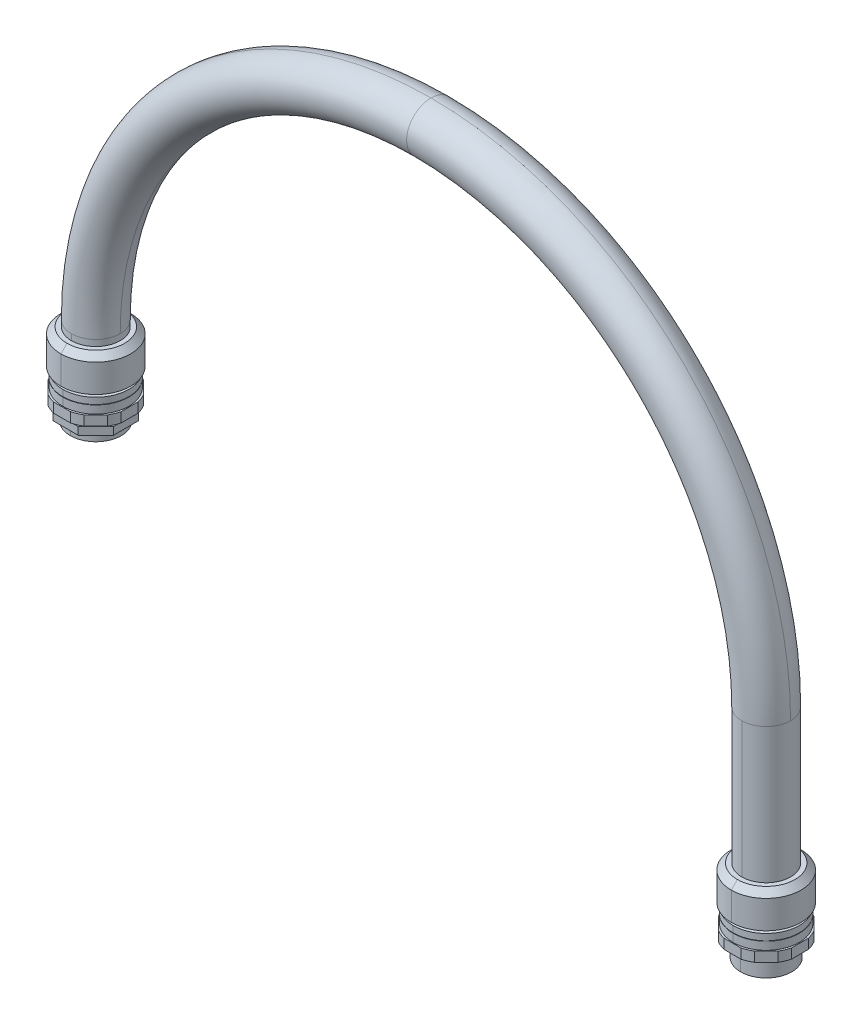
ISO-10303-21;
HEADER;
FILE_DESCRIPTION(('STEP AP214'),'2;1');
FILE_NAME('part.step','',(''),(''),'','','');
FILE_SCHEMA(('AUTOMOTIVE_DESIGN { 1 0 10303 214 1 1 1 1 }'));
ENDSEC;
DATA;
#1=APPLICATION_CONTEXT('core data for automotive mechanical design processes');
#2=APPLICATION_PROTOCOL_DEFINITION('international standard','automotive_design',2000,#1);
#3=PRODUCT_CONTEXT('',#1,'mechanical');
#4=PRODUCT('Part','Part','',(#3));
#5=PRODUCT_RELATED_PRODUCT_CATEGORY('part','',(#4));
#6=PRODUCT_DEFINITION_FORMATION('','',#4);
#7=PRODUCT_DEFINITION_CONTEXT('part definition',#1,'design');
#8=PRODUCT_DEFINITION('design','',#6,#7);
#9=PRODUCT_DEFINITION_SHAPE('','',#8);
#10=(LENGTH_UNIT() NAMED_UNIT(*) SI_UNIT(.MILLI.,.METRE.));
#11=(NAMED_UNIT(*) PLANE_ANGLE_UNIT() SI_UNIT($,.RADIAN.));
#12=(NAMED_UNIT(*) SI_UNIT($,.STERADIAN.) SOLID_ANGLE_UNIT());
#13=UNCERTAINTY_MEASURE_WITH_UNIT(LENGTH_MEASURE(1.E-05),#10,'distance_accuracy_value','');
#14=(GEOMETRIC_REPRESENTATION_CONTEXT(3) GLOBAL_UNCERTAINTY_ASSIGNED_CONTEXT((#13)) GLOBAL_UNIT_ASSIGNED_CONTEXT((#10,
#11,#12)) REPRESENTATION_CONTEXT('',''));
#15=CARTESIAN_POINT('',(0.,0.,0.));
#16=DIRECTION('',(0.,0.,1.));
#17=DIRECTION('',(1.,0.,0.));
#18=AXIS2_PLACEMENT_3D('',#15,#16,#17);
#19=CARTESIAN_POINT('',(-522.9,130.,0.));
#20=DIRECTION('',(0.,-1.,0.));
#21=DIRECTION('',(0.,0.,-1.));
#22=AXIS2_PLACEMENT_3D('',#19,#20,#21);
#23=PLANE('',#22);
#24=CARTESIAN_POINT('',(-550.,130.,0.));
#25=DIRECTION('',(0.,1.,0.));
#26=DIRECTION('',(0.970331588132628,0.,-0.241778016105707));
#27=AXIS2_PLACEMENT_3D('',#24,#25,#26);
#28=CIRCLE('',#27,28.65);
#29=CARTESIAN_POINT('',(-522.2,130.,-6.926940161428));
#30=VERTEX_POINT('',#29);
#31=CARTESIAN_POINT('',(-525.444345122,130.,-14.75948215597));
#32=VERTEX_POINT('',#31);
#33=EDGE_CURVE('E10',#30,#32,#28,.T.);
#34=ORIENTED_EDGE('',*,*,#33,.T.);
#35=DIRECTION('',(-0.707106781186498,0.,-0.707106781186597));
#36=VECTOR('',#35,1.);
#37=CARTESIAN_POINT('',(-525.444345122,130.,-14.75948215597));
#38=LINE('',#37,#36);
#39=CARTESIAN_POINT('',(-535.240517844,130.,-24.55565487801));
#40=VERTEX_POINT('',#39);
#41=EDGE_CURVE('E26',#32,#40,#38,.T.);
#42=ORIENTED_EDGE('',*,*,#41,.T.);
#43=CARTESIAN_POINT('',(-550.,130.,0.));
#44=DIRECTION('',(0.,1.,0.));
#45=DIRECTION('',(0.515165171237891,0.,-0.857090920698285));
#46=AXIS2_PLACEMENT_3D('',#43,#44,#45);
#47=CIRCLE('',#46,28.65);
#48=CARTESIAN_POINT('',(-543.0730598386,130.,-27.8));
#49=VERTEX_POINT('',#48);
#50=EDGE_CURVE('E509',#40,#49,#47,.T.);
#51=ORIENTED_EDGE('',*,*,#50,.T.);
#52=DIRECTION('',(-1.,0.,0.));
#53=VECTOR('',#52,1.);
#54=CARTESIAN_POINT('',(-543.0730598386,130.,-27.8));
#55=LINE('',#54,#53);
#56=CARTESIAN_POINT('',(-556.9269401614,130.,-27.8));
#57=VERTEX_POINT('',#56);
#58=EDGE_CURVE('E513',#49,#57,#55,.T.);
#59=ORIENTED_EDGE('',*,*,#58,.T.);
#60=CARTESIAN_POINT('',(-550.,130.,0.));
#61=DIRECTION('',(0.,1.,0.));
#62=DIRECTION('',(-0.241778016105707,0.,-0.970331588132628));
#63=AXIS2_PLACEMENT_3D('',#60,#61,#62);
#64=CIRCLE('',#63,28.65);
#65=CARTESIAN_POINT('',(-564.759482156,130.,-24.55565487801));
#66=VERTEX_POINT('',#65);
#67=EDGE_CURVE('E522',#57,#66,#64,.T.);
#68=ORIENTED_EDGE('',*,*,#67,.T.);
#69=DIRECTION('',(-0.707106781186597,0.,0.707106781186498));
#70=VECTOR('',#69,1.);
#71=CARTESIAN_POINT('',(-564.759482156,130.,-24.55565487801));
#72=LINE('',#71,#70);
#73=CARTESIAN_POINT('',(-574.555654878,130.,-14.75948215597));
#74=VERTEX_POINT('',#73);
#75=EDGE_CURVE('E1001',#66,#74,#72,.T.);
#76=ORIENTED_EDGE('',*,*,#75,.T.);
#77=CARTESIAN_POINT('',(-550.,130.,0.));
#78=DIRECTION('',(0.,1.,0.));
#79=DIRECTION('',(-0.857090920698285,0.,-0.515165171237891));
#80=AXIS2_PLACEMENT_3D('',#77,#78,#79);
#81=CIRCLE('',#80,28.65);
#82=CARTESIAN_POINT('',(-577.8,130.,-6.926940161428));
#83=VERTEX_POINT('',#82);
#84=EDGE_CURVE('E997',#74,#83,#81,.T.);
#85=ORIENTED_EDGE('',*,*,#84,.T.);
#86=DIRECTION('',(0.,0.,1.));
#87=VECTOR('',#86,1.);
#88=CARTESIAN_POINT('',(-577.8,130.,-6.926940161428));
#89=LINE('',#88,#87);
#90=CARTESIAN_POINT('',(-577.8,130.,6.926940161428));
#91=VERTEX_POINT('',#90);
#92=EDGE_CURVE('E759',#83,#91,#89,.T.);
#93=ORIENTED_EDGE('',*,*,#92,.T.);
#94=CARTESIAN_POINT('',(-550.,130.,0.));
#95=DIRECTION('',(0.,1.,0.));
#96=DIRECTION('',(-0.970331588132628,0.,0.241778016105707));
#97=AXIS2_PLACEMENT_3D('',#94,#95,#96);
#98=CIRCLE('',#97,28.65);
#99=CARTESIAN_POINT('',(-574.555654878,130.,14.75948215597));
#100=VERTEX_POINT('',#99);
#101=EDGE_CURVE('E755',#91,#100,#98,.T.);
#102=ORIENTED_EDGE('',*,*,#101,.T.);
#103=DIRECTION('',(0.707106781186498,0.,0.707106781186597));
#104=VECTOR('',#103,1.);
#105=CARTESIAN_POINT('',(-574.555654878,130.,14.75948215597));
#106=LINE('',#105,#104);
#107=CARTESIAN_POINT('',(-564.759482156,130.,24.55565487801));
#108=VERTEX_POINT('',#107);
#109=EDGE_CURVE('E760',#100,#108,#106,.T.);
#110=ORIENTED_EDGE('',*,*,#109,.T.);
#111=CARTESIAN_POINT('',(-550.,130.,0.));
#112=DIRECTION('',(0.,1.,0.));
#113=DIRECTION('',(-0.515165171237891,0.,0.857090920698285));
#114=AXIS2_PLACEMENT_3D('',#111,#112,#113);
#115=CIRCLE('',#114,28.65);
#116=CARTESIAN_POINT('',(-556.9269401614,130.,27.8));
#117=VERTEX_POINT('',#116);
#118=EDGE_CURVE('E947',#108,#117,#115,.T.);
#119=ORIENTED_EDGE('',*,*,#118,.T.);
#120=DIRECTION('',(1.,0.,0.));
#121=VECTOR('',#120,1.);
#122=CARTESIAN_POINT('',(-556.9269401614,130.,27.8));
#123=LINE('',#122,#121);
#124=CARTESIAN_POINT('',(-543.0730598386,130.,27.8));
#125=VERTEX_POINT('',#124);
#126=EDGE_CURVE('E951',#117,#125,#123,.T.);
#127=ORIENTED_EDGE('',*,*,#126,.T.);
#128=CARTESIAN_POINT('',(-550.,130.,0.));
#129=DIRECTION('',(0.,1.,0.));
#130=DIRECTION('',(0.241778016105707,0.,0.970331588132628));
#131=AXIS2_PLACEMENT_3D('',#128,#129,#130);
#132=CIRCLE('',#131,28.65);
#133=CARTESIAN_POINT('',(-535.240517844,130.,24.55565487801));
#134=VERTEX_POINT('',#133);
#135=EDGE_CURVE('E661',#125,#134,#132,.T.);
#136=ORIENTED_EDGE('',*,*,#135,.T.);
#137=DIRECTION('',(0.707106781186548,0.,-0.707106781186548));
#138=VECTOR('',#137,1.);
#139=CARTESIAN_POINT('',(-535.240517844,130.,24.55565487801));
#140=LINE('',#139,#138);
#141=CARTESIAN_POINT('',(-525.444345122,130.,14.75948215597));
#142=VERTEX_POINT('',#141);
#143=EDGE_CURVE('E657',#134,#142,#140,.T.);
#144=ORIENTED_EDGE('',*,*,#143,.T.);
#145=CARTESIAN_POINT('',(-550.,130.,0.));
#146=DIRECTION('',(0.,1.,0.));
#147=DIRECTION('',(0.857090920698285,0.,0.515165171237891));
#148=AXIS2_PLACEMENT_3D('',#145,#146,#147);
#149=CIRCLE('',#148,28.65);
#150=CARTESIAN_POINT('',(-522.2,130.,6.926940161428));
#151=VERTEX_POINT('',#150);
#152=EDGE_CURVE('E662',#142,#151,#149,.T.);
#153=ORIENTED_EDGE('',*,*,#152,.T.);
#154=DIRECTION('',(0.,0.,-1.));
#155=VECTOR('',#154,1.);
#156=CARTESIAN_POINT('',(-522.2,130.,6.926940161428));
#157=LINE('',#156,#155);
#158=EDGE_CURVE('E829',#151,#30,#157,.T.);
#159=ORIENTED_EDGE('',*,*,#158,.T.);
#160=EDGE_LOOP('',(#34,#42,#51,#59,#68,#76,#85,#93,#102,#110,#119,#127,#136,#144,#153,#159));
#161=FACE_BOUND('',#160,.T.);
#162=CARTESIAN_POINT('',(-550.,130.,0.));
#163=DIRECTION('',(0.,-1.,0.));
#164=DIRECTION('',(0.,0.,1.));
#165=AXIS2_PLACEMENT_3D('',#162,#163,#164);
#166=CIRCLE('',#165,27.1);
#167=CARTESIAN_POINT('',(-550.,130.,27.1));
#168=VERTEX_POINT('',#167);
#169=CARTESIAN_POINT('',(-550.,130.,-27.1));
#170=VERTEX_POINT('',#169);
#171=EDGE_CURVE('E914',#168,#170,#166,.T.);
#172=ORIENTED_EDGE('',*,*,#171,.T.);
#173=CARTESIAN_POINT('',(-550.,130.,0.));
#174=DIRECTION('',(0.,-1.,0.));
#175=DIRECTION('',(0.,0.,-1.));
#176=AXIS2_PLACEMENT_3D('',#173,#174,#175);
#177=CIRCLE('',#176,27.1);
#178=EDGE_CURVE('E938',#170,#168,#177,.T.);
#179=ORIENTED_EDGE('',*,*,#178,.T.);
#180=EDGE_LOOP('',(#172,#179));
#181=FACE_BOUND('',#180,.T.);
#182=ADVANCED_FACE('F15',(#161,#181),#23,.F.);
#183=CARTESIAN_POINT('',(-522.2,130.,-11.51513703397));
#184=DIRECTION('',(1.,0.,0.));
#185=DIRECTION('',(0.,1.,0.));
#186=AXIS2_PLACEMENT_3D('',#183,#184,#185);
#187=PLANE('',#186);
#188=DIRECTION('',(0.,0.,1.));
#189=VECTOR('',#188,1.);
#190=CARTESIAN_POINT('',(-522.2,122.,-6.926940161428));
#191=LINE('',#190,#189);
#192=CARTESIAN_POINT('',(-522.2,122.,-6.926940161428));
#193=VERTEX_POINT('',#192);
#194=CARTESIAN_POINT('',(-522.2,122.,6.926940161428));
#195=VERTEX_POINT('',#194);
#196=EDGE_CURVE('E794',#193,#195,#191,.T.);
#197=ORIENTED_EDGE('',*,*,#196,.F.);
#198=DIRECTION('',(0.,-1.,0.));
#199=VECTOR('',#198,1.);
#200=CARTESIAN_POINT('',(-522.2,130.,-6.926940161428));
#201=LINE('',#200,#199);
#202=EDGE_CURVE('E667',#30,#193,#201,.T.);
#203=ORIENTED_EDGE('',*,*,#202,.F.);
#204=ORIENTED_EDGE('',*,*,#158,.F.);
#205=DIRECTION('',(0.,1.,0.));
#206=VECTOR('',#205,1.);
#207=CARTESIAN_POINT('',(-522.2,122.,6.926940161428));
#208=LINE('',#207,#206);
#209=EDGE_CURVE('E1024',#195,#151,#208,.T.);
#210=ORIENTED_EDGE('',*,*,#209,.F.);
#211=EDGE_LOOP('',(#197,#203,#204,#210));
#212=FACE_BOUND('',#211,.T.);
#213=ADVANCED_FACE('F1607',(#212),#187,.T.);
#214=CARTESIAN_POINT('',(-550.,106.,0.));
#215=DIRECTION('',(0.,-1.,0.));
#216=DIRECTION('',(0.,0.,-1.));
#217=AXIS2_PLACEMENT_3D('',#214,#215,#216);
#218=CYLINDRICAL_SURFACE('',#217,28.65);
#219=CARTESIAN_POINT('',(-550.,122.,0.));
#220=DIRECTION('',(0.,-1.,0.));
#221=DIRECTION('',(0.970331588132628,0.,0.241778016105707));
#222=AXIS2_PLACEMENT_3D('',#219,#220,#221);
#223=CIRCLE('',#222,28.65);
#224=CARTESIAN_POINT('',(-525.444345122,122.,14.75948215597));
#225=VERTEX_POINT('',#224);
#226=EDGE_CURVE('E768',#195,#225,#223,.T.);
#227=ORIENTED_EDGE('',*,*,#226,.F.);
#228=ORIENTED_EDGE('',*,*,#209,.T.);
#229=ORIENTED_EDGE('',*,*,#152,.F.);
#230=DIRECTION('',(0.,-1.,0.));
#231=VECTOR('',#230,1.);
#232=CARTESIAN_POINT('',(-525.444345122,130.,14.75948215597));
#233=LINE('',#232,#231);
#234=EDGE_CURVE('E1028',#142,#225,#233,.T.);
#235=ORIENTED_EDGE('',*,*,#234,.T.);
#236=EDGE_LOOP('',(#227,#228,#229,#235));
#237=FACE_BOUND('',#236,.T.);
#238=ADVANCED_FACE('F1613',(#237),#218,.T.);
#239=CARTESIAN_POINT('',(-522.2,130.,11.51513703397));
#240=DIRECTION('',(0.707106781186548,0.,0.707106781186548));
#241=DIRECTION('',(0.,-1.,0.));
#242=AXIS2_PLACEMENT_3D('',#239,#240,#241);
#243=PLANE('',#242);
#244=DIRECTION('',(-0.707106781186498,0.,0.707106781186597));
#245=VECTOR('',#244,1.);
#246=CARTESIAN_POINT('',(-525.444345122,122.,14.75948215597));
#247=LINE('',#246,#245);
#248=CARTESIAN_POINT('',(-535.240517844,122.,24.55565487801));
#249=VERTEX_POINT('',#248);
#250=EDGE_CURVE('E672',#225,#249,#247,.T.);
#251=ORIENTED_EDGE('',*,*,#250,.F.);
#252=ORIENTED_EDGE('',*,*,#234,.F.);
#253=ORIENTED_EDGE('',*,*,#143,.F.);
#254=DIRECTION('',(0.,1.,0.));
#255=VECTOR('',#254,1.);
#256=CARTESIAN_POINT('',(-535.240517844,122.,24.55565487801));
#257=LINE('',#256,#255);
#258=EDGE_CURVE('E919',#249,#134,#257,.T.);
#259=ORIENTED_EDGE('',*,*,#258,.F.);
#260=EDGE_LOOP('',(#251,#252,#253,#259));
#261=FACE_BOUND('',#260,.T.);
#262=ADVANCED_FACE('F1644',(#261),#243,.T.);
#263=CARTESIAN_POINT('',(-550.,106.,0.));
#264=DIRECTION('',(0.,-1.,0.));
#265=DIRECTION('',(0.,0.,-1.));
#266=AXIS2_PLACEMENT_3D('',#263,#264,#265);
#267=CYLINDRICAL_SURFACE('',#266,28.65);
#268=CARTESIAN_POINT('',(-550.,122.,0.));
#269=DIRECTION('',(0.,-1.,0.));
#270=DIRECTION('',(0.515165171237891,0.,0.857090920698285));
#271=AXIS2_PLACEMENT_3D('',#268,#269,#270);
#272=CIRCLE('',#271,28.65);
#273=CARTESIAN_POINT('',(-543.0730598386,122.,27.8));
#274=VERTEX_POINT('',#273);
#275=EDGE_CURVE('E669',#249,#274,#272,.T.);
#276=ORIENTED_EDGE('',*,*,#275,.F.);
#277=ORIENTED_EDGE('',*,*,#258,.T.);
#278=ORIENTED_EDGE('',*,*,#135,.F.);
#279=DIRECTION('',(0.,-1.,0.));
#280=VECTOR('',#279,1.);
#281=CARTESIAN_POINT('',(-543.0730598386,130.,27.8));
#282=LINE('',#281,#280);
#283=EDGE_CURVE('E915',#125,#274,#282,.T.);
#284=ORIENTED_EDGE('',*,*,#283,.T.);
#285=EDGE_LOOP('',(#276,#277,#278,#284));
#286=FACE_BOUND('',#285,.T.);
#287=ADVANCED_FACE('F1647',(#286),#267,.T.);
#288=CARTESIAN_POINT('',(-538.484862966,130.,27.8));
#289=DIRECTION('',(0.,0.,1.));
#290=DIRECTION('',(1.,0.,0.));
#291=AXIS2_PLACEMENT_3D('',#288,#289,#290);
#292=PLANE('',#291);
#293=DIRECTION('',(-1.,0.,0.));
#294=VECTOR('',#293,1.);
#295=CARTESIAN_POINT('',(-543.0730598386,122.,27.8));
#296=LINE('',#295,#294);
#297=CARTESIAN_POINT('',(-556.9269401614,122.,27.8));
#298=VERTEX_POINT('',#297);
#299=EDGE_CURVE('E673',#274,#298,#296,.T.);
#300=ORIENTED_EDGE('',*,*,#299,.F.);
#301=ORIENTED_EDGE('',*,*,#283,.F.);
#302=ORIENTED_EDGE('',*,*,#126,.F.);
#303=DIRECTION('',(0.,1.,0.));
#304=VECTOR('',#303,1.);
#305=CARTESIAN_POINT('',(-556.9269401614,122.,27.8));
#306=LINE('',#305,#304);
#307=EDGE_CURVE('E727',#298,#117,#306,.T.);
#308=ORIENTED_EDGE('',*,*,#307,.F.);
#309=EDGE_LOOP('',(#300,#301,#302,#308));
#310=FACE_BOUND('',#309,.T.);
#311=ADVANCED_FACE('F1833',(#310),#292,.T.);
#312=CARTESIAN_POINT('',(-550.,106.,0.));
#313=DIRECTION('',(0.,-1.,0.));
#314=DIRECTION('',(0.,0.,-1.));
#315=AXIS2_PLACEMENT_3D('',#312,#313,#314);
#316=CYLINDRICAL_SURFACE('',#315,28.65);
#317=CARTESIAN_POINT('',(-550.,122.,0.));
#318=DIRECTION('',(0.,-1.,0.));
#319=DIRECTION('',(-0.241778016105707,0.,0.970331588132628));
#320=AXIS2_PLACEMENT_3D('',#317,#318,#319);
#321=CIRCLE('',#320,28.65);
#322=CARTESIAN_POINT('',(-564.759482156,122.,24.55565487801));
#323=VERTEX_POINT('',#322);
#324=EDGE_CURVE('E931',#298,#323,#321,.T.);
#325=ORIENTED_EDGE('',*,*,#324,.F.);
#326=ORIENTED_EDGE('',*,*,#307,.T.);
#327=ORIENTED_EDGE('',*,*,#118,.F.);
#328=DIRECTION('',(0.,-1.,0.));
#329=VECTOR('',#328,1.);
#330=CARTESIAN_POINT('',(-564.759482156,130.,24.55565487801));
#331=LINE('',#330,#329);
#332=EDGE_CURVE('E723',#108,#323,#331,.T.);
#333=ORIENTED_EDGE('',*,*,#332,.T.);
#334=EDGE_LOOP('',(#325,#326,#327,#333));
#335=FACE_BOUND('',#334,.T.);
#336=ADVANCED_FACE('F1747',(#335),#316,.T.);
#337=CARTESIAN_POINT('',(-561.515137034,130.,27.8));
#338=DIRECTION('',(-0.707106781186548,0.,0.707106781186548));
#339=DIRECTION('',(0.,1.,0.));
#340=AXIS2_PLACEMENT_3D('',#337,#338,#339);
#341=PLANE('',#340);
#342=DIRECTION('',(-0.707106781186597,0.,-0.707106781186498));
#343=VECTOR('',#342,1.);
#344=CARTESIAN_POINT('',(-564.759482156,122.,24.55565487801));
#345=LINE('',#344,#343);
#346=CARTESIAN_POINT('',(-574.555654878,122.,14.75948215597));
#347=VERTEX_POINT('',#346);
#348=EDGE_CURVE('E1051',#323,#347,#345,.T.);
#349=ORIENTED_EDGE('',*,*,#348,.F.);
#350=ORIENTED_EDGE('',*,*,#332,.F.);
#351=ORIENTED_EDGE('',*,*,#109,.F.);
#352=DIRECTION('',(0.,1.,0.));
#353=VECTOR('',#352,1.);
#354=CARTESIAN_POINT('',(-574.555654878,122.,14.75948215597));
#355=LINE('',#354,#353);
#356=EDGE_CURVE('E626',#347,#100,#355,.T.);
#357=ORIENTED_EDGE('',*,*,#356,.F.);
#358=EDGE_LOOP('',(#349,#350,#351,#357));
#359=FACE_BOUND('',#358,.T.);
#360=ADVANCED_FACE('F1458',(#359),#341,.T.);
#361=CARTESIAN_POINT('',(-550.,106.,0.));
#362=DIRECTION('',(0.,-1.,0.));
#363=DIRECTION('',(0.,0.,-1.));
#364=AXIS2_PLACEMENT_3D('',#361,#362,#363);
#365=CYLINDRICAL_SURFACE('',#364,28.65);
#366=ORIENTED_EDGE('',*,*,#101,.F.);
#367=DIRECTION('',(0.,-1.,0.));
#368=VECTOR('',#367,1.);
#369=CARTESIAN_POINT('',(-577.8,130.,6.926940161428));
#370=LINE('',#369,#368);
#371=CARTESIAN_POINT('',(-577.8,122.,6.926940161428));
#372=VERTEX_POINT('',#371);
#373=EDGE_CURVE('E728',#91,#372,#370,.T.);
#374=ORIENTED_EDGE('',*,*,#373,.T.);
#375=CARTESIAN_POINT('',(-550.,122.,0.));
#376=DIRECTION('',(0.,-1.,0.));
#377=DIRECTION('',(-0.857090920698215,0.,0.515165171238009));
#378=AXIS2_PLACEMENT_3D('',#375,#376,#377);
#379=CIRCLE('',#378,28.65);
#380=EDGE_CURVE('E622',#347,#372,#379,.T.);
#381=ORIENTED_EDGE('',*,*,#380,.F.);
#382=ORIENTED_EDGE('',*,*,#356,.T.);
#383=EDGE_LOOP('',(#366,#374,#381,#382));
#384=FACE_BOUND('',#383,.T.);
#385=ADVANCED_FACE('F1444',(#384),#365,.T.);
#386=CARTESIAN_POINT('',(-521.35,122.,0.));
#387=DIRECTION('',(0.,1.,0.));
#388=DIRECTION('',(1.,0.,0.));
#389=AXIS2_PLACEMENT_3D('',#386,#387,#388);
#390=PLANE('',#389);
#391=ORIENTED_EDGE('',*,*,#380,.T.);
#392=DIRECTION('',(0.,0.,-1.));
#393=VECTOR('',#392,1.);
#394=CARTESIAN_POINT('',(-577.8,122.,6.926940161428));
#395=LINE('',#394,#393);
#396=CARTESIAN_POINT('',(-577.8,122.,-6.926940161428));
#397=VERTEX_POINT('',#396);
#398=EDGE_CURVE('E627',#372,#397,#395,.T.);
#399=ORIENTED_EDGE('',*,*,#398,.T.);
#400=CARTESIAN_POINT('',(-550.,122.,0.));
#401=DIRECTION('',(0.,-1.,0.));
#402=DIRECTION('',(-0.970331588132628,0.,-0.241778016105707));
#403=AXIS2_PLACEMENT_3D('',#400,#401,#402);
#404=CIRCLE('',#403,28.65);
#405=CARTESIAN_POINT('',(-574.555654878,122.,-14.75948215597));
#406=VERTEX_POINT('',#405);
#407=EDGE_CURVE('E858',#397,#406,#404,.T.);
#408=ORIENTED_EDGE('',*,*,#407,.T.);
#409=DIRECTION('',(0.707106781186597,0.,-0.707106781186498));
#410=VECTOR('',#409,1.);
#411=CARTESIAN_POINT('',(-574.555654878,122.,-14.75948215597));
#412=LINE('',#411,#410);
#413=CARTESIAN_POINT('',(-564.759482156,122.,-24.55565487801));
#414=VERTEX_POINT('',#413);
#415=EDGE_CURVE('E854',#406,#414,#412,.T.);
#416=ORIENTED_EDGE('',*,*,#415,.T.);
#417=CARTESIAN_POINT('',(-550.,122.,0.));
#418=DIRECTION('',(0.,-1.,0.));
#419=DIRECTION('',(-0.515165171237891,0.,-0.857090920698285));
#420=AXIS2_PLACEMENT_3D('',#417,#418,#419);
#421=CIRCLE('',#420,28.65);
#422=CARTESIAN_POINT('',(-556.9269401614,122.,-27.8));
#423=VERTEX_POINT('',#422);
#424=EDGE_CURVE('E859',#414,#423,#421,.T.);
#425=ORIENTED_EDGE('',*,*,#424,.T.);
#426=DIRECTION('',(1.,0.,0.));
#427=VECTOR('',#426,1.);
#428=CARTESIAN_POINT('',(-556.9269401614,122.,-27.8));
#429=LINE('',#428,#427);
#430=CARTESIAN_POINT('',(-543.0730598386,122.,-27.8));
#431=VERTEX_POINT('',#430);
#432=EDGE_CURVE('E1035',#423,#431,#429,.T.);
#433=ORIENTED_EDGE('',*,*,#432,.T.);
#434=CARTESIAN_POINT('',(-550.,122.,0.));
#435=DIRECTION('',(0.,-1.,0.));
#436=DIRECTION('',(0.241778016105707,0.,-0.970331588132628));
#437=AXIS2_PLACEMENT_3D('',#434,#435,#436);
#438=CIRCLE('',#437,28.65);
#439=CARTESIAN_POINT('',(-535.240517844,122.,-24.55565487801));
#440=VERTEX_POINT('',#439);
#441=EDGE_CURVE('E749',#431,#440,#438,.T.);
#442=ORIENTED_EDGE('',*,*,#441,.T.);
#443=DIRECTION('',(0.707106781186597,0.,0.707106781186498));
#444=VECTOR('',#443,1.);
#445=CARTESIAN_POINT('',(-535.240517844,122.,-24.55565487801));
#446=LINE('',#445,#444);
#447=CARTESIAN_POINT('',(-525.444345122,122.,-14.75948215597));
#448=VERTEX_POINT('',#447);
#449=EDGE_CURVE('E745',#440,#448,#446,.T.);
#450=ORIENTED_EDGE('',*,*,#449,.T.);
#451=CARTESIAN_POINT('',(-550.,122.,0.));
#452=DIRECTION('',(0.,-1.,0.));
#453=DIRECTION('',(0.857090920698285,0.,-0.515165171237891));
#454=AXIS2_PLACEMENT_3D('',#451,#452,#453);
#455=CIRCLE('',#454,28.65);
#456=EDGE_CURVE('E750',#448,#193,#455,.T.);
#457=ORIENTED_EDGE('',*,*,#456,.T.);
#458=ORIENTED_EDGE('',*,*,#196,.T.);
#459=ORIENTED_EDGE('',*,*,#226,.T.);
#460=ORIENTED_EDGE('',*,*,#250,.T.);
#461=ORIENTED_EDGE('',*,*,#275,.T.);
#462=ORIENTED_EDGE('',*,*,#299,.T.);
#463=ORIENTED_EDGE('',*,*,#324,.T.);
#464=ORIENTED_EDGE('',*,*,#348,.T.);
#465=EDGE_LOOP('',(#391,#399,#408,#416,#425,#433,#442,#450,#457,#458,#459,#460,#461,#462,#463,#464));
#466=FACE_BOUND('',#465,.T.);
#467=CARTESIAN_POINT('',(-550.,122.,0.));
#468=DIRECTION('',(0.,1.,0.));
#469=DIRECTION('',(0.,0.,1.));
#470=AXIS2_PLACEMENT_3D('',#467,#468,#469);
#471=CIRCLE('',#470,20.95);
#472=CARTESIAN_POINT('',(-550.,122.,20.95));
#473=VERTEX_POINT('',#472);
#474=CARTESIAN_POINT('',(-550.,122.,-20.95));
#475=VERTEX_POINT('',#474);
#476=EDGE_CURVE('E538',#473,#475,#471,.T.);
#477=ORIENTED_EDGE('',*,*,#476,.T.);
#478=CARTESIAN_POINT('',(-550.,122.,0.));
#479=DIRECTION('',(0.,1.,0.));
#480=DIRECTION('',(0.,0.,-1.));
#481=AXIS2_PLACEMENT_3D('',#478,#479,#480);
#482=CIRCLE('',#481,20.95);
#483=EDGE_CURVE('E535',#475,#473,#482,.T.);
#484=ORIENTED_EDGE('',*,*,#483,.T.);
#485=EDGE_LOOP('',(#477,#484));
#486=FACE_BOUND('',#485,.T.);
#487=ADVANCED_FACE('F1663',(#466,#486),#390,.F.);
#488=CARTESIAN_POINT('',(-550.,106.,0.));
#489=DIRECTION('',(0.,-1.,0.));
#490=DIRECTION('',(0.,0.,-1.));
#491=AXIS2_PLACEMENT_3D('',#488,#489,#490);
#492=CYLINDRICAL_SURFACE('',#491,20.95);
#493=DIRECTION('',(0.,-1.,0.));
#494=VECTOR('',#493,1.);
#495=CARTESIAN_POINT('',(-550.,122.,20.95));
#496=LINE('',#495,#494);
#497=CARTESIAN_POINT('',(-550.,119.5,20.95));
#498=VERTEX_POINT('',#497);
#499=EDGE_CURVE('E943',#473,#498,#496,.T.);
#500=ORIENTED_EDGE('',*,*,#499,.F.);
#501=ORIENTED_EDGE('',*,*,#483,.F.);
#502=DIRECTION('',(0.,-1.,0.));
#503=VECTOR('',#502,1.);
#504=CARTESIAN_POINT('',(-550.,122.,-20.95));
#505=LINE('',#504,#503);
#506=CARTESIAN_POINT('',(-550.,119.5,-20.95));
#507=VERTEX_POINT('',#506);
#508=EDGE_CURVE('E539',#475,#507,#505,.T.);
#509=ORIENTED_EDGE('',*,*,#508,.T.);
#510=CARTESIAN_POINT('',(-550.,119.5,0.));
#511=DIRECTION('',(0.,-1.,0.));
#512=DIRECTION('',(0.,0.,1.));
#513=AXIS2_PLACEMENT_3D('',#510,#511,#512);
#514=CIRCLE('',#513,20.95);
#515=EDGE_CURVE('E939',#498,#507,#514,.T.);
#516=ORIENTED_EDGE('',*,*,#515,.F.);
#517=EDGE_LOOP('',(#500,#501,#509,#516));
#518=FACE_BOUND('',#517,.T.);
#519=ADVANCED_FACE('F1724',(#518),#492,.T.);
#520=CARTESIAN_POINT('',(0.,119.5,0.));
#521=DIRECTION('',(0.,1.,0.));
#522=DIRECTION('',(1.,0.,0.));
#523=AXIS2_PLACEMENT_3D('',#520,#521,#522);
#524=PLANE('',#523);
#525=DIRECTION('',(0.707106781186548,0.,0.707106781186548));
#526=VECTOR('',#525,1.);
#527=CARTESIAN_POINT('',(-574.6999193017,119.5,10.23104156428));
#528=LINE('',#527,#526);
#529=CARTESIAN_POINT('',(-574.6999193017,119.5,10.23104156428));
#530=VERTEX_POINT('',#529);
#531=CARTESIAN_POINT('',(-560.2310415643,119.5,24.69991930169));
#532=VERTEX_POINT('',#531);
#533=EDGE_CURVE('E975',#530,#532,#528,.T.);
#534=ORIENTED_EDGE('',*,*,#533,.T.);
#535=DIRECTION('',(-1.,0.,0.));
#536=VECTOR('',#535,1.);
#537=CARTESIAN_POINT('',(-539.7689584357,119.5,24.69991930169));
#538=LINE('',#537,#536);
#539=CARTESIAN_POINT('',(-539.7689584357,119.5,24.69991930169));
#540=VERTEX_POINT('',#539);
#541=EDGE_CURVE('E674',#540,#532,#538,.T.);
#542=ORIENTED_EDGE('',*,*,#541,.F.);
#543=DIRECTION('',(0.707106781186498,0.,-0.707106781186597));
#544=VECTOR('',#543,1.);
#545=CARTESIAN_POINT('',(-539.7689584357,119.5,24.69991930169));
#546=LINE('',#545,#544);
#547=CARTESIAN_POINT('',(-525.3000806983,119.5,10.23104156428));
#548=VERTEX_POINT('',#547);
#549=EDGE_CURVE('E972',#540,#548,#546,.T.);
#550=ORIENTED_EDGE('',*,*,#549,.T.);
#551=DIRECTION('',(0.,0.,1.));
#552=VECTOR('',#551,1.);
#553=CARTESIAN_POINT('',(-525.3000806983,119.5,-10.23104156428));
#554=LINE('',#553,#552);
#555=CARTESIAN_POINT('',(-525.3000806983,119.5,-10.23104156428));
#556=VERTEX_POINT('',#555);
#557=EDGE_CURVE('E588',#556,#548,#554,.T.);
#558=ORIENTED_EDGE('',*,*,#557,.F.);
#559=DIRECTION('',(-0.707106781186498,0.,-0.707106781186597));
#560=VECTOR('',#559,1.);
#561=CARTESIAN_POINT('',(-525.3000806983,119.5,-10.23104156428));
#562=LINE('',#561,#560);
#563=CARTESIAN_POINT('',(-539.7689584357,119.5,-24.69991930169));
#564=VERTEX_POINT('',#563);
#565=EDGE_CURVE('E976',#556,#564,#562,.T.);
#566=ORIENTED_EDGE('',*,*,#565,.T.);
#567=DIRECTION('',(1.,0.,0.));
#568=VECTOR('',#567,1.);
#569=CARTESIAN_POINT('',(-560.2310415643,119.5,-24.69991930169));
#570=LINE('',#569,#568);
#571=CARTESIAN_POINT('',(-560.2310415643,119.5,-24.69991930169));
#572=VERTEX_POINT('',#571);
#573=EDGE_CURVE('E578',#572,#564,#570,.T.);
#574=ORIENTED_EDGE('',*,*,#573,.F.);
#575=DIRECTION('',(-0.707106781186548,0.,0.707106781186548));
#576=VECTOR('',#575,1.);
#577=CARTESIAN_POINT('',(-560.2310415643,119.5,-24.69991930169));
#578=LINE('',#577,#576);
#579=CARTESIAN_POINT('',(-574.6999193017,119.5,-10.23104156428));
#580=VERTEX_POINT('',#579);
#581=EDGE_CURVE('E1065',#572,#580,#578,.T.);
#582=ORIENTED_EDGE('',*,*,#581,.T.);
#583=DIRECTION('',(0.,0.,-1.));
#584=VECTOR('',#583,1.);
#585=CARTESIAN_POINT('',(-574.6999193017,119.5,10.23104156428));
#586=LINE('',#585,#584);
#587=EDGE_CURVE('E993',#530,#580,#586,.T.);
#588=ORIENTED_EDGE('',*,*,#587,.F.);
#589=EDGE_LOOP('',(#534,#542,#550,#558,#566,#574,#582,#588));
#590=FACE_BOUND('',#589,.T.);
#591=CARTESIAN_POINT('',(-550.,119.5,0.));
#592=DIRECTION('',(0.,-1.,0.));
#593=DIRECTION('',(0.,0.,-1.));
#594=AXIS2_PLACEMENT_3D('',#591,#592,#593);
#595=CIRCLE('',#594,20.95);
#596=EDGE_CURVE('E942',#507,#498,#595,.T.);
#597=ORIENTED_EDGE('',*,*,#596,.T.);
#598=ORIENTED_EDGE('',*,*,#515,.T.);
#599=EDGE_LOOP('',(#597,#598));
#600=FACE_BOUND('',#599,.T.);
#601=ADVANCED_FACE('F1250',(#590,#600),#524,.T.);
#602=CARTESIAN_POINT('',(-550.,106.,0.));
#603=DIRECTION('',(0.,-1.,0.));
#604=DIRECTION('',(0.,0.,-1.));
#605=AXIS2_PLACEMENT_3D('',#602,#603,#604);
#606=CYLINDRICAL_SURFACE('',#605,20.95);
#607=ORIENTED_EDGE('',*,*,#508,.F.);
#608=ORIENTED_EDGE('',*,*,#476,.F.);
#609=ORIENTED_EDGE('',*,*,#499,.T.);
#610=ORIENTED_EDGE('',*,*,#596,.F.);
#611=EDGE_LOOP('',(#607,#608,#609,#610));
#612=FACE_BOUND('',#611,.T.);
#613=ADVANCED_FACE('F1842',(#612),#606,.T.);
#614=CARTESIAN_POINT('',(-574.6999193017,119.5,-10.23104156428));
#615=DIRECTION('',(1.,0.,0.));
#616=DIRECTION('',(0.,1.,0.));
#617=AXIS2_PLACEMENT_3D('',#614,#615,#616);
#618=PLANE('',#617);
#619=DIRECTION('',(0.,1.,0.));
#620=VECTOR('',#619,1.);
#621=CARTESIAN_POINT('',(-574.6999193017,113.3,10.23104156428));
#622=LINE('',#621,#620);
#623=CARTESIAN_POINT('',(-574.6999193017,113.3,10.23104156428));
#624=VERTEX_POINT('',#623);
#625=EDGE_CURVE('E1173',#624,#530,#622,.T.);
#626=ORIENTED_EDGE('',*,*,#625,.T.);
#627=ORIENTED_EDGE('',*,*,#587,.T.);
#628=DIRECTION('',(0.,1.,0.));
#629=VECTOR('',#628,1.);
#630=CARTESIAN_POINT('',(-574.6999193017,113.3,-10.23104156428));
#631=LINE('',#630,#629);
#632=CARTESIAN_POINT('',(-574.6999193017,113.3,-10.23104156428));
#633=VERTEX_POINT('',#632);
#634=EDGE_CURVE('E591',#633,#580,#631,.T.);
#635=ORIENTED_EDGE('',*,*,#634,.F.);
#636=DIRECTION('',(0.,0.,-1.));
#637=VECTOR('',#636,1.);
#638=CARTESIAN_POINT('',(-574.6999193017,113.3,10.23104156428));
#639=LINE('',#638,#637);
#640=EDGE_CURVE('E738',#624,#633,#639,.T.);
#641=ORIENTED_EDGE('',*,*,#640,.F.);
#642=EDGE_LOOP('',(#626,#627,#635,#641));
#643=FACE_BOUND('',#642,.T.);
#644=ADVANCED_FACE('F1583',(#643),#618,.F.);
#645=CARTESIAN_POINT('',(0.,113.3,0.));
#646=DIRECTION('',(0.,1.,0.));
#647=DIRECTION('',(1.,0.,0.));
#648=AXIS2_PLACEMENT_3D('',#645,#646,#647);
#649=PLANE('',#648);
#650=DIRECTION('',(0.707106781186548,0.,-0.707106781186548));
#651=VECTOR('',#650,1.);
#652=CARTESIAN_POINT('',(-574.6999193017,113.3,-10.23104156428));
#653=LINE('',#652,#651);
#654=CARTESIAN_POINT('',(-560.2310415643,113.3,-24.69991930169));
#655=VERTEX_POINT('',#654);
#656=EDGE_CURVE('E989',#633,#655,#653,.T.);
#657=ORIENTED_EDGE('',*,*,#656,.T.);
#658=DIRECTION('',(1.,0.,0.));
#659=VECTOR('',#658,1.);
#660=CARTESIAN_POINT('',(-560.2310415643,113.3,-24.69991930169));
#661=LINE('',#660,#659);
#662=CARTESIAN_POINT('',(-539.7689584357,113.3,-24.69991930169));
#663=VERTEX_POINT('',#662);
#664=EDGE_CURVE('E806',#655,#663,#661,.T.);
#665=ORIENTED_EDGE('',*,*,#664,.T.);
#666=DIRECTION('',(0.707106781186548,0.,0.707106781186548));
#667=VECTOR('',#666,1.);
#668=CARTESIAN_POINT('',(-539.7689584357,113.3,-24.69991930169));
#669=LINE('',#668,#667);
#670=CARTESIAN_POINT('',(-525.3000806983,113.3,-10.23104156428));
#671=VERTEX_POINT('',#670);
#672=EDGE_CURVE('E802',#663,#671,#669,.T.);
#673=ORIENTED_EDGE('',*,*,#672,.T.);
#674=DIRECTION('',(0.,0.,1.));
#675=VECTOR('',#674,1.);
#676=CARTESIAN_POINT('',(-525.3000806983,113.3,-10.23104156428));
#677=LINE('',#676,#675);
#678=CARTESIAN_POINT('',(-525.3000806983,113.3,10.23104156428));
#679=VERTEX_POINT('',#678);
#680=EDGE_CURVE('E807',#671,#679,#677,.T.);
#681=ORIENTED_EDGE('',*,*,#680,.T.);
#682=DIRECTION('',(-0.707106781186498,0.,0.707106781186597));
#683=VECTOR('',#682,1.);
#684=CARTESIAN_POINT('',(-525.3000806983,113.3,10.23104156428));
#685=LINE('',#684,#683);
#686=CARTESIAN_POINT('',(-539.7689584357,113.3,24.69991930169));
#687=VERTEX_POINT('',#686);
#688=EDGE_CURVE('E812',#679,#687,#685,.T.);
#689=ORIENTED_EDGE('',*,*,#688,.T.);
#690=DIRECTION('',(-1.,0.,0.));
#691=VECTOR('',#690,1.);
#692=CARTESIAN_POINT('',(-539.7689584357,113.3,24.69991930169));
#693=LINE('',#692,#691);
#694=CARTESIAN_POINT('',(-560.2310415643,113.3,24.69991930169));
#695=VERTEX_POINT('',#694);
#696=EDGE_CURVE('E808',#687,#695,#693,.T.);
#697=ORIENTED_EDGE('',*,*,#696,.T.);
#698=DIRECTION('',(-0.707106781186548,0.,-0.707106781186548));
#699=VECTOR('',#698,1.);
#700=CARTESIAN_POINT('',(-560.2310415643,113.3,24.69991930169));
#701=LINE('',#700,#699);
#702=EDGE_CURVE('E813',#695,#624,#701,.T.);
#703=ORIENTED_EDGE('',*,*,#702,.T.);
#704=ORIENTED_EDGE('',*,*,#640,.T.);
#705=EDGE_LOOP('',(#657,#665,#673,#681,#689,#697,#703,#704));
#706=FACE_BOUND('',#705,.T.);
#707=CARTESIAN_POINT('',(-550.,113.3,0.));
#708=DIRECTION('',(0.,1.,0.));
#709=DIRECTION('',(0.,0.,-1.));
#710=AXIS2_PLACEMENT_3D('',#707,#708,#709);
#711=CIRCLE('',#710,20.95);
#712=CARTESIAN_POINT('',(-550.,113.3,-20.95));
#713=VERTEX_POINT('',#712);
#714=CARTESIAN_POINT('',(-550.,113.3,20.95));
#715=VERTEX_POINT('',#714);
#716=EDGE_CURVE('E681',#713,#715,#711,.T.);
#717=ORIENTED_EDGE('',*,*,#716,.T.);
#718=CARTESIAN_POINT('',(-550.,113.3,0.));
#719=DIRECTION('',(0.,1.,0.));
#720=DIRECTION('',(0.,0.,1.));
#721=AXIS2_PLACEMENT_3D('',#718,#719,#720);
#722=CIRCLE('',#721,20.95);
#723=EDGE_CURVE('E678',#715,#713,#722,.T.);
#724=ORIENTED_EDGE('',*,*,#723,.T.);
#725=EDGE_LOOP('',(#717,#724));
#726=FACE_BOUND('',#725,.T.);
#727=ADVANCED_FACE('F1260',(#706,#726),#649,.F.);
#728=CARTESIAN_POINT('',(-550.,106.,0.));
#729=DIRECTION('',(0.,-1.,0.));
#730=DIRECTION('',(0.,0.,-1.));
#731=AXIS2_PLACEMENT_3D('',#728,#729,#730);
#732=CYLINDRICAL_SURFACE('',#731,20.95);
#733=DIRECTION('',(0.,-1.,0.));
#734=VECTOR('',#733,1.);
#735=CARTESIAN_POINT('',(-550.,113.3,-20.95));
#736=LINE('',#735,#734);
#737=CARTESIAN_POINT('',(-550.,106.,-20.95));
#738=VERTEX_POINT('',#737);
#739=EDGE_CURVE('E550',#713,#738,#736,.T.);
#740=ORIENTED_EDGE('',*,*,#739,.F.);
#741=ORIENTED_EDGE('',*,*,#723,.F.);
#742=DIRECTION('',(0.,-1.,0.));
#743=VECTOR('',#742,1.);
#744=CARTESIAN_POINT('',(-550.,113.3,20.95));
#745=LINE('',#744,#743);
#746=CARTESIAN_POINT('',(-550.,106.,20.95));
#747=VERTEX_POINT('',#746);
#748=EDGE_CURVE('E682',#715,#747,#745,.T.);
#749=ORIENTED_EDGE('',*,*,#748,.T.);
#750=CARTESIAN_POINT('',(-550.,106.,0.));
#751=DIRECTION('',(0.,-1.,0.));
#752=DIRECTION('',(0.,0.,-1.));
#753=AXIS2_PLACEMENT_3D('',#750,#751,#752);
#754=CIRCLE('',#753,20.95);
#755=EDGE_CURVE('E607',#738,#747,#754,.T.);
#756=ORIENTED_EDGE('',*,*,#755,.F.);
#757=EDGE_LOOP('',(#740,#741,#749,#756));
#758=FACE_BOUND('',#757,.T.);
#759=ADVANCED_FACE('F1720',(#758),#732,.T.);
#760=CARTESIAN_POINT('',(-529.05,106.,0.));
#761=DIRECTION('',(0.,1.,0.));
#762=DIRECTION('',(1.,0.,0.));
#763=AXIS2_PLACEMENT_3D('',#760,#761,#762);
#764=PLANE('',#763);
#765=CARTESIAN_POINT('',(-550.,106.,0.));
#766=DIRECTION('',(0.,-1.,0.));
#767=DIRECTION('',(0.,0.,1.));
#768=AXIS2_PLACEMENT_3D('',#765,#766,#767);
#769=CIRCLE('',#768,20.95);
#770=EDGE_CURVE('E754',#747,#738,#769,.T.);
#771=ORIENTED_EDGE('',*,*,#770,.T.);
#772=ORIENTED_EDGE('',*,*,#755,.T.);
#773=EDGE_LOOP('',(#771,#772));
#774=FACE_BOUND('',#773,.T.);
#775=ADVANCED_FACE('F1716',(#774),#764,.F.);
#776=CARTESIAN_POINT('',(-550.,106.,0.));
#777=DIRECTION('',(0.,-1.,0.));
#778=DIRECTION('',(0.,0.,-1.));
#779=AXIS2_PLACEMENT_3D('',#776,#777,#778);
#780=CYLINDRICAL_SURFACE('',#779,20.95);
#781=ORIENTED_EDGE('',*,*,#748,.F.);
#782=ORIENTED_EDGE('',*,*,#716,.F.);
#783=ORIENTED_EDGE('',*,*,#739,.T.);
#784=ORIENTED_EDGE('',*,*,#770,.F.);
#785=EDGE_LOOP('',(#781,#782,#783,#784));
#786=FACE_BOUND('',#785,.T.);
#787=ADVANCED_FACE('F1719',(#786),#780,.T.);
#788=CARTESIAN_POINT('',(-574.6999193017,119.5,10.23104156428));
#789=DIRECTION('',(0.707106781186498,0.,-0.707106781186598));
#790=DIRECTION('',(0.,-1.,0.));
#791=AXIS2_PLACEMENT_3D('',#788,#789,#790);
#792=PLANE('',#791);
#793=DIRECTION('',(0.,1.,0.));
#794=VECTOR('',#793,1.);
#795=CARTESIAN_POINT('',(-560.2310415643,113.3,24.69991930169));
#796=LINE('',#795,#794);
#797=EDGE_CURVE('E546',#695,#532,#796,.T.);
#798=ORIENTED_EDGE('',*,*,#797,.T.);
#799=ORIENTED_EDGE('',*,*,#533,.F.);
#800=ORIENTED_EDGE('',*,*,#625,.F.);
#801=ORIENTED_EDGE('',*,*,#702,.F.);
#802=EDGE_LOOP('',(#798,#799,#800,#801));
#803=FACE_BOUND('',#802,.T.);
#804=ADVANCED_FACE('F1580',(#803),#792,.F.);
#805=CARTESIAN_POINT('',(-560.2310415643,119.5,24.69991930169));
#806=DIRECTION('',(0.,0.,-1.));
#807=DIRECTION('',(0.,-1.,0.));
#808=AXIS2_PLACEMENT_3D('',#805,#806,#807);
#809=PLANE('',#808);
#810=DIRECTION('',(0.,1.,0.));
#811=VECTOR('',#810,1.);
#812=CARTESIAN_POINT('',(-539.7689584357,113.3,24.69991930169));
#813=LINE('',#812,#811);
#814=EDGE_CURVE('E551',#687,#540,#813,.T.);
#815=ORIENTED_EDGE('',*,*,#814,.T.);
#816=ORIENTED_EDGE('',*,*,#541,.T.);
#817=ORIENTED_EDGE('',*,*,#797,.F.);
#818=ORIENTED_EDGE('',*,*,#696,.F.);
#819=EDGE_LOOP('',(#815,#816,#817,#818));
#820=FACE_BOUND('',#819,.T.);
#821=ADVANCED_FACE('F1690',(#820),#809,.F.);
#822=CARTESIAN_POINT('',(-539.7689584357,119.5,24.69991930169));
#823=DIRECTION('',(-0.707106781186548,0.,-0.707106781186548));
#824=DIRECTION('',(-0.707106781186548,0.,0.707106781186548));
#825=AXIS2_PLACEMENT_3D('',#822,#823,#824);
#826=PLANE('',#825);
#827=DIRECTION('',(0.,1.,0.));
#828=VECTOR('',#827,1.);
#829=CARTESIAN_POINT('',(-525.3000806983,113.3,10.23104156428));
#830=LINE('',#829,#828);
#831=EDGE_CURVE('E677',#679,#548,#830,.T.);
#832=ORIENTED_EDGE('',*,*,#831,.T.);
#833=ORIENTED_EDGE('',*,*,#549,.F.);
#834=ORIENTED_EDGE('',*,*,#814,.F.);
#835=ORIENTED_EDGE('',*,*,#688,.F.);
#836=EDGE_LOOP('',(#832,#833,#834,#835));
#837=FACE_BOUND('',#836,.T.);
#838=ADVANCED_FACE('F1256',(#837),#826,.F.);
#839=CARTESIAN_POINT('',(-525.3000806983,119.5,10.23104156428));
#840=DIRECTION('',(-1.,0.,0.));
#841=DIRECTION('',(0.,0.,1.));
#842=AXIS2_PLACEMENT_3D('',#839,#840,#841);
#843=PLANE('',#842);
#844=DIRECTION('',(0.,1.,0.));
#845=VECTOR('',#844,1.);
#846=CARTESIAN_POINT('',(-525.3000806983,113.3,-10.23104156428));
#847=LINE('',#846,#845);
#848=EDGE_CURVE('E889',#671,#556,#847,.T.);
#849=ORIENTED_EDGE('',*,*,#848,.T.);
#850=ORIENTED_EDGE('',*,*,#557,.T.);
#851=ORIENTED_EDGE('',*,*,#831,.F.);
#852=ORIENTED_EDGE('',*,*,#680,.F.);
#853=EDGE_LOOP('',(#849,#850,#851,#852));
#854=FACE_BOUND('',#853,.T.);
#855=ADVANCED_FACE('F1240',(#854),#843,.F.);
#856=CARTESIAN_POINT('',(-525.3000806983,119.5,-10.23104156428));
#857=DIRECTION('',(-0.707106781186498,0.,0.707106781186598));
#858=DIRECTION('',(0.,1.,0.));
#859=AXIS2_PLACEMENT_3D('',#856,#857,#858);
#860=PLANE('',#859);
#861=DIRECTION('',(0.,1.,0.));
#862=VECTOR('',#861,1.);
#863=CARTESIAN_POINT('',(-539.7689584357,113.3,-24.69991930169));
#864=LINE('',#863,#862);
#865=EDGE_CURVE('E577',#663,#564,#864,.T.);
#866=ORIENTED_EDGE('',*,*,#865,.T.);
#867=ORIENTED_EDGE('',*,*,#565,.F.);
#868=ORIENTED_EDGE('',*,*,#848,.F.);
#869=ORIENTED_EDGE('',*,*,#672,.F.);
#870=EDGE_LOOP('',(#866,#867,#868,#869));
#871=FACE_BOUND('',#870,.T.);
#872=ADVANCED_FACE('F1590',(#871),#860,.F.);
#873=CARTESIAN_POINT('',(-539.7689584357,119.5,-24.69991930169));
#874=DIRECTION('',(0.,0.,1.));
#875=DIRECTION('',(1.,0.,0.));
#876=AXIS2_PLACEMENT_3D('',#873,#874,#875);
#877=PLANE('',#876);
#878=DIRECTION('',(0.,1.,0.));
#879=VECTOR('',#878,1.);
#880=CARTESIAN_POINT('',(-560.2310415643,113.3,-24.69991930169));
#881=LINE('',#880,#879);
#882=EDGE_CURVE('E574',#655,#572,#881,.T.);
#883=ORIENTED_EDGE('',*,*,#882,.T.);
#884=ORIENTED_EDGE('',*,*,#573,.T.);
#885=ORIENTED_EDGE('',*,*,#865,.F.);
#886=ORIENTED_EDGE('',*,*,#664,.F.);
#887=EDGE_LOOP('',(#883,#884,#885,#886));
#888=FACE_BOUND('',#887,.T.);
#889=ADVANCED_FACE('F1588',(#888),#877,.F.);
#890=CARTESIAN_POINT('',(-560.2310415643,119.5,-24.69991930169));
#891=DIRECTION('',(0.707106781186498,0.,0.707106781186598));
#892=DIRECTION('',(0.,-1.,0.));
#893=AXIS2_PLACEMENT_3D('',#890,#891,#892);
#894=PLANE('',#893);
#895=ORIENTED_EDGE('',*,*,#634,.T.);
#896=ORIENTED_EDGE('',*,*,#581,.F.);
#897=ORIENTED_EDGE('',*,*,#882,.F.);
#898=ORIENTED_EDGE('',*,*,#656,.F.);
#899=EDGE_LOOP('',(#895,#896,#897,#898));
#900=FACE_BOUND('',#899,.T.);
#901=ADVANCED_FACE('F1586',(#900),#894,.F.);
#902=CARTESIAN_POINT('',(-550.,106.,0.));
#903=DIRECTION('',(0.,-1.,0.));
#904=DIRECTION('',(0.,0.,-1.));
#905=AXIS2_PLACEMENT_3D('',#902,#903,#904);
#906=CYLINDRICAL_SURFACE('',#905,28.65);
#907=ORIENTED_EDGE('',*,*,#456,.F.);
#908=DIRECTION('',(0.,1.,0.));
#909=VECTOR('',#908,1.);
#910=CARTESIAN_POINT('',(-525.444345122,122.,-14.75948215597));
#911=LINE('',#910,#909);
#912=EDGE_CURVE('E601',#448,#32,#911,.T.);
#913=ORIENTED_EDGE('',*,*,#912,.T.);
#914=ORIENTED_EDGE('',*,*,#33,.F.);
#915=ORIENTED_EDGE('',*,*,#202,.T.);
#916=EDGE_LOOP('',(#907,#913,#914,#915));
#917=FACE_BOUND('',#916,.T.);
#918=ADVANCED_FACE('F1623',(#917),#906,.T.);
#919=CARTESIAN_POINT('',(-538.484862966,130.,-27.8));
#920=DIRECTION('',(0.707106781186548,0.,-0.707106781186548));
#921=DIRECTION('',(0.,-1.,0.));
#922=AXIS2_PLACEMENT_3D('',#919,#920,#921);
#923=PLANE('',#922);
#924=ORIENTED_EDGE('',*,*,#449,.F.);
#925=DIRECTION('',(0.,-1.,0.));
#926=VECTOR('',#925,1.);
#927=CARTESIAN_POINT('',(-535.240517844,130.,-24.55565487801));
#928=LINE('',#927,#926);
#929=EDGE_CURVE('E668',#40,#440,#928,.T.);
#930=ORIENTED_EDGE('',*,*,#929,.F.);
#931=ORIENTED_EDGE('',*,*,#41,.F.);
#932=ORIENTED_EDGE('',*,*,#912,.F.);
#933=EDGE_LOOP('',(#924,#930,#931,#932));
#934=FACE_BOUND('',#933,.T.);
#935=ADVANCED_FACE('F1619',(#934),#923,.T.);
#936=CARTESIAN_POINT('',(-550.,106.,0.));
#937=DIRECTION('',(0.,-1.,0.));
#938=DIRECTION('',(0.,0.,-1.));
#939=AXIS2_PLACEMENT_3D('',#936,#937,#938);
#940=CYLINDRICAL_SURFACE('',#939,28.65);
#941=ORIENTED_EDGE('',*,*,#441,.F.);
#942=DIRECTION('',(0.,1.,0.));
#943=VECTOR('',#942,1.);
#944=CARTESIAN_POINT('',(-543.0730598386,122.,-27.8));
#945=LINE('',#944,#943);
#946=EDGE_CURVE('E663',#431,#49,#945,.T.);
#947=ORIENTED_EDGE('',*,*,#946,.T.);
#948=ORIENTED_EDGE('',*,*,#50,.F.);
#949=ORIENTED_EDGE('',*,*,#929,.T.);
#950=EDGE_LOOP('',(#941,#947,#948,#949));
#951=FACE_BOUND('',#950,.T.);
#952=ADVANCED_FACE('F1622',(#951),#940,.T.);
#953=CARTESIAN_POINT('',(-561.515137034,130.,-27.8));
#954=DIRECTION('',(0.,0.,-1.));
#955=DIRECTION('',(0.,-1.,0.));
#956=AXIS2_PLACEMENT_3D('',#953,#954,#955);
#957=PLANE('',#956);
#958=ORIENTED_EDGE('',*,*,#432,.F.);
#959=DIRECTION('',(0.,-1.,0.));
#960=VECTOR('',#959,1.);
#961=CARTESIAN_POINT('',(-556.9269401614,130.,-27.8));
#962=LINE('',#961,#960);
#963=EDGE_CURVE('E643',#57,#423,#962,.T.);
#964=ORIENTED_EDGE('',*,*,#963,.F.);
#965=ORIENTED_EDGE('',*,*,#58,.F.);
#966=ORIENTED_EDGE('',*,*,#946,.F.);
#967=EDGE_LOOP('',(#958,#964,#965,#966));
#968=FACE_BOUND('',#967,.T.);
#969=ADVANCED_FACE('F1743',(#968),#957,.T.);
#970=CARTESIAN_POINT('',(-550.,106.,0.));
#971=DIRECTION('',(0.,-1.,0.));
#972=DIRECTION('',(0.,0.,-1.));
#973=AXIS2_PLACEMENT_3D('',#970,#971,#972);
#974=CYLINDRICAL_SURFACE('',#973,28.65);
#975=ORIENTED_EDGE('',*,*,#424,.F.);
#976=DIRECTION('',(0.,1.,0.));
#977=VECTOR('',#976,1.);
#978=CARTESIAN_POINT('',(-564.759482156,122.,-24.55565487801));
#979=LINE('',#978,#977);
#980=EDGE_CURVE('E647',#414,#66,#979,.T.);
#981=ORIENTED_EDGE('',*,*,#980,.T.);
#982=ORIENTED_EDGE('',*,*,#67,.F.);
#983=ORIENTED_EDGE('',*,*,#963,.T.);
#984=EDGE_LOOP('',(#975,#981,#982,#983));
#985=FACE_BOUND('',#984,.T.);
#986=ADVANCED_FACE('F1740',(#985),#974,.T.);
#987=CARTESIAN_POINT('',(-577.8,130.,-11.51513703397));
#988=DIRECTION('',(-0.707106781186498,0.,-0.707106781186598));
#989=DIRECTION('',(-0.707106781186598,0.,0.707106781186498));
#990=AXIS2_PLACEMENT_3D('',#987,#988,#989);
#991=PLANE('',#990);
#992=ORIENTED_EDGE('',*,*,#415,.F.);
#993=DIRECTION('',(0.,-1.,0.));
#994=VECTOR('',#993,1.);
#995=CARTESIAN_POINT('',(-574.555654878,130.,-14.75948215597));
#996=LINE('',#995,#994);
#997=EDGE_CURVE('E833',#74,#406,#996,.T.);
#998=ORIENTED_EDGE('',*,*,#997,.F.);
#999=ORIENTED_EDGE('',*,*,#75,.F.);
#1000=ORIENTED_EDGE('',*,*,#980,.F.);
#1001=EDGE_LOOP('',(#992,#998,#999,#1000));
#1002=FACE_BOUND('',#1001,.T.);
#1003=ADVANCED_FACE('F1714',(#1002),#991,.T.);
#1004=CARTESIAN_POINT('',(-550.,106.,0.));
#1005=DIRECTION('',(0.,-1.,0.));
#1006=DIRECTION('',(0.,0.,-1.));
#1007=AXIS2_PLACEMENT_3D('',#1004,#1005,#1006);
#1008=CYLINDRICAL_SURFACE('',#1007,28.65);
#1009=ORIENTED_EDGE('',*,*,#407,.F.);
#1010=DIRECTION('',(0.,1.,0.));
#1011=VECTOR('',#1010,1.);
#1012=CARTESIAN_POINT('',(-577.8,122.,-6.926940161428));
#1013=LINE('',#1012,#1011);
#1014=EDGE_CURVE('E648',#397,#83,#1013,.T.);
#1015=ORIENTED_EDGE('',*,*,#1014,.T.);
#1016=ORIENTED_EDGE('',*,*,#84,.F.);
#1017=ORIENTED_EDGE('',*,*,#997,.T.);
#1018=EDGE_LOOP('',(#1009,#1015,#1016,#1017));
#1019=FACE_BOUND('',#1018,.T.);
#1020=ADVANCED_FACE('F1711',(#1019),#1008,.T.);
#1021=CARTESIAN_POINT('',(-577.8,130.,11.51513703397));
#1022=DIRECTION('',(-1.,0.,0.));
#1023=DIRECTION('',(0.,0.,1.));
#1024=AXIS2_PLACEMENT_3D('',#1021,#1022,#1023);
#1025=PLANE('',#1024);
#1026=ORIENTED_EDGE('',*,*,#398,.F.);
#1027=ORIENTED_EDGE('',*,*,#373,.F.);
#1028=ORIENTED_EDGE('',*,*,#92,.F.);
#1029=ORIENTED_EDGE('',*,*,#1014,.F.);
#1030=EDGE_LOOP('',(#1026,#1027,#1028,#1029));
#1031=FACE_BOUND('',#1030,.T.);
#1032=ADVANCED_FACE('F1440',(#1031),#1025,.T.);
#1033=CARTESIAN_POINT('',(-550.,106.,0.));
#1034=DIRECTION('',(0.,-1.,0.));
#1035=DIRECTION('',(0.,0.,-1.));
#1036=AXIS2_PLACEMENT_3D('',#1033,#1034,#1035);
#1037=CYLINDRICAL_SURFACE('',#1036,27.1);
#1038=DIRECTION('',(0.,-1.,0.));
#1039=VECTOR('',#1038,1.);
#1040=CARTESIAN_POINT('',(-550.,136.5,-27.1));
#1041=LINE('',#1040,#1039);
#1042=CARTESIAN_POINT('',(-550.,136.5,-27.1));
#1043=VERTEX_POINT('',#1042);
#1044=EDGE_CURVE('E628',#1043,#170,#1041,.T.);
#1045=ORIENTED_EDGE('',*,*,#1044,.F.);
#1046=CARTESIAN_POINT('',(-550.,136.5,0.));
#1047=DIRECTION('',(0.,1.,0.));
#1048=DIRECTION('',(0.,0.,1.));
#1049=AXIS2_PLACEMENT_3D('',#1046,#1047,#1048);
#1050=CIRCLE('',#1049,27.1);
#1051=CARTESIAN_POINT('',(-550.,136.5,27.1));
#1052=VERTEX_POINT('',#1051);
#1053=EDGE_CURVE('E633',#1052,#1043,#1050,.T.);
#1054=ORIENTED_EDGE('',*,*,#1053,.F.);
#1055=DIRECTION('',(0.,-1.,0.));
#1056=VECTOR('',#1055,1.);
#1057=CARTESIAN_POINT('',(-550.,136.5,27.1));
#1058=LINE('',#1057,#1056);
#1059=EDGE_CURVE('E632',#1052,#168,#1058,.T.);
#1060=ORIENTED_EDGE('',*,*,#1059,.T.);
#1061=ORIENTED_EDGE('',*,*,#178,.F.);
#1062=EDGE_LOOP('',(#1045,#1054,#1060,#1061));
#1063=FACE_BOUND('',#1062,.T.);
#1064=ADVANCED_FACE('F1702',(#1063),#1037,.T.);
#1065=CARTESIAN_POINT('',(-550.,106.,0.));
#1066=DIRECTION('',(0.,-1.,0.));
#1067=DIRECTION('',(0.,0.,-1.));
#1068=AXIS2_PLACEMENT_3D('',#1065,#1066,#1067);
#1069=CYLINDRICAL_SURFACE('',#1068,27.1);
#1070=ORIENTED_EDGE('',*,*,#1059,.F.);
#1071=CARTESIAN_POINT('',(-550.,136.5,0.));
#1072=DIRECTION('',(0.,1.,0.));
#1073=DIRECTION('',(0.,0.,-1.));
#1074=AXIS2_PLACEMENT_3D('',#1071,#1072,#1073);
#1075=CIRCLE('',#1074,27.1);
#1076=EDGE_CURVE('E920',#1043,#1052,#1075,.T.);
#1077=ORIENTED_EDGE('',*,*,#1076,.F.);
#1078=ORIENTED_EDGE('',*,*,#1044,.T.);
#1079=ORIENTED_EDGE('',*,*,#171,.F.);
#1080=EDGE_LOOP('',(#1070,#1077,#1078,#1079));
#1081=FACE_BOUND('',#1080,.T.);
#1082=ADVANCED_FACE('F1698',(#1081),#1069,.T.);
#1083=CARTESIAN_POINT('',(-523.9,136.5,0.));
#1084=DIRECTION('',(0.,-1.,0.));
#1085=DIRECTION('',(0.,0.,-1.));
#1086=AXIS2_PLACEMENT_3D('',#1083,#1084,#1085);
#1087=PLANE('',#1086);
#1088=ORIENTED_EDGE('',*,*,#1053,.T.);
#1089=ORIENTED_EDGE('',*,*,#1076,.T.);
#1090=EDGE_LOOP('',(#1088,#1089));
#1091=FACE_BOUND('',#1090,.T.);
#1092=CARTESIAN_POINT('',(-550.,136.5,0.));
#1093=DIRECTION('',(0.,-1.,0.));
#1094=DIRECTION('',(0.,0.,1.));
#1095=AXIS2_PLACEMENT_3D('',#1092,#1093,#1094);
#1096=CIRCLE('',#1095,26.1);
#1097=CARTESIAN_POINT('',(-550.,136.5,26.1));
#1098=VERTEX_POINT('',#1097);
#1099=CARTESIAN_POINT('',(-550.,136.5,-26.1));
#1100=VERTEX_POINT('',#1099);
#1101=EDGE_CURVE('E696',#1098,#1100,#1096,.T.);
#1102=ORIENTED_EDGE('',*,*,#1101,.T.);
#1103=CARTESIAN_POINT('',(-550.,136.5,0.));
#1104=DIRECTION('',(0.,-1.,0.));
#1105=DIRECTION('',(0.,0.,-1.));
#1106=AXIS2_PLACEMENT_3D('',#1103,#1104,#1105);
#1107=CIRCLE('',#1106,26.1);
#1108=EDGE_CURVE('E489',#1100,#1098,#1107,.T.);
#1109=ORIENTED_EDGE('',*,*,#1108,.T.);
#1110=EDGE_LOOP('',(#1102,#1109));
#1111=FACE_BOUND('',#1110,.T.);
#1112=ADVANCED_FACE('F1701',(#1091,#1111),#1087,.F.);
#1113=CARTESIAN_POINT('',(-550.,106.,0.));
#1114=DIRECTION('',(0.,-1.,0.));
#1115=DIRECTION('',(0.,0.,-1.));
#1116=AXIS2_PLACEMENT_3D('',#1113,#1114,#1115);
#1117=CYLINDRICAL_SURFACE('',#1116,26.1);
#1118=DIRECTION('',(0.,-1.,0.));
#1119=VECTOR('',#1118,1.);
#1120=CARTESIAN_POINT('',(-550.,136.8,-26.1));
#1121=LINE('',#1120,#1119);
#1122=CARTESIAN_POINT('',(-550.,136.8,-26.1));
#1123=VERTEX_POINT('',#1122);
#1124=EDGE_CURVE('E490',#1123,#1100,#1121,.T.);
#1125=ORIENTED_EDGE('',*,*,#1124,.F.);
#1126=CARTESIAN_POINT('',(-550.,136.8,0.));
#1127=DIRECTION('',(0.,1.,0.));
#1128=DIRECTION('',(0.,0.,1.));
#1129=AXIS2_PLACEMENT_3D('',#1126,#1127,#1128);
#1130=CIRCLE('',#1129,26.1);
#1131=CARTESIAN_POINT('',(-550.,136.8,26.1));
#1132=VERTEX_POINT('',#1131);
#1133=EDGE_CURVE('E608',#1132,#1123,#1130,.T.);
#1134=ORIENTED_EDGE('',*,*,#1133,.F.);
#1135=DIRECTION('',(0.,-1.,0.));
#1136=VECTOR('',#1135,1.);
#1137=CARTESIAN_POINT('',(-550.,136.8,26.1));
#1138=LINE('',#1137,#1136);
#1139=EDGE_CURVE('E485',#1132,#1098,#1138,.T.);
#1140=ORIENTED_EDGE('',*,*,#1139,.T.);
#1141=ORIENTED_EDGE('',*,*,#1108,.F.);
#1142=EDGE_LOOP('',(#1125,#1134,#1140,#1141));
#1143=FACE_BOUND('',#1142,.T.);
#1144=ADVANCED_FACE('F1799',(#1143),#1117,.T.);
#1145=CARTESIAN_POINT('',(-550.,106.,0.));
#1146=DIRECTION('',(0.,-1.,0.));
#1147=DIRECTION('',(0.,0.,-1.));
#1148=AXIS2_PLACEMENT_3D('',#1145,#1146,#1147);
#1149=CYLINDRICAL_SURFACE('',#1148,26.1);
#1150=ORIENTED_EDGE('',*,*,#1139,.F.);
#1151=CARTESIAN_POINT('',(-550.,136.8,0.));
#1152=DIRECTION('',(0.,1.,0.));
#1153=DIRECTION('',(0.,0.,-1.));
#1154=AXIS2_PLACEMENT_3D('',#1151,#1152,#1153);
#1155=CIRCLE('',#1154,26.1);
#1156=EDGE_CURVE('E544',#1123,#1132,#1155,.T.);
#1157=ORIENTED_EDGE('',*,*,#1156,.F.);
#1158=ORIENTED_EDGE('',*,*,#1124,.T.);
#1159=ORIENTED_EDGE('',*,*,#1101,.F.);
#1160=EDGE_LOOP('',(#1150,#1157,#1158,#1159));
#1161=FACE_BOUND('',#1160,.T.);
#1162=ADVANCED_FACE('F1816',(#1161),#1149,.T.);
#1163=CARTESIAN_POINT('',(-522.9,136.8,0.));
#1164=DIRECTION('',(0.,1.,0.));
#1165=DIRECTION('',(1.,0.,0.));
#1166=AXIS2_PLACEMENT_3D('',#1163,#1164,#1165);
#1167=PLANE('',#1166);
#1168=CARTESIAN_POINT('',(-550.,136.8,0.));
#1169=DIRECTION('',(0.,-1.,0.));
#1170=DIRECTION('',(0.,0.,1.));
#1171=AXIS2_PLACEMENT_3D('',#1168,#1169,#1170);
#1172=CIRCLE('',#1171,27.1);
#1173=CARTESIAN_POINT('',(-550.,136.8,27.1));
#1174=VERTEX_POINT('',#1173);
#1175=CARTESIAN_POINT('',(-550.,136.8,-27.1));
#1176=VERTEX_POINT('',#1175);
#1177=EDGE_CURVE('E878',#1174,#1176,#1172,.T.);
#1178=ORIENTED_EDGE('',*,*,#1177,.T.);
#1179=CARTESIAN_POINT('',(-550.,136.8,0.));
#1180=DIRECTION('',(0.,-1.,0.));
#1181=DIRECTION('',(0.,0.,-1.));
#1182=AXIS2_PLACEMENT_3D('',#1179,#1180,#1181);
#1183=CIRCLE('',#1182,27.1);
#1184=EDGE_CURVE('E612',#1176,#1174,#1183,.T.);
#1185=ORIENTED_EDGE('',*,*,#1184,.T.);
#1186=EDGE_LOOP('',(#1178,#1185));
#1187=FACE_BOUND('',#1186,.T.);
#1188=ORIENTED_EDGE('',*,*,#1133,.T.);
#1189=ORIENTED_EDGE('',*,*,#1156,.T.);
#1190=EDGE_LOOP('',(#1188,#1189));
#1191=FACE_BOUND('',#1190,.T.);
#1192=ADVANCED_FACE('F1771',(#1187,#1191),#1167,.F.);
#1193=CARTESIAN_POINT('',(-550.,106.,0.));
#1194=DIRECTION('',(0.,-1.,0.));
#1195=DIRECTION('',(0.,0.,-1.));
#1196=AXIS2_PLACEMENT_3D('',#1193,#1194,#1195);
#1197=CYLINDRICAL_SURFACE('',#1196,27.1);
#1198=DIRECTION('',(0.,-1.,0.));
#1199=VECTOR('',#1198,1.);
#1200=CARTESIAN_POINT('',(-550.,142.,-27.1));
#1201=LINE('',#1200,#1199);
#1202=CARTESIAN_POINT('',(-550.,142.,-27.1));
#1203=VERTEX_POINT('',#1202);
#1204=EDGE_CURVE('E545',#1203,#1176,#1201,.T.);
#1205=ORIENTED_EDGE('',*,*,#1204,.F.);
#1206=CARTESIAN_POINT('',(-550.,142.,0.));
#1207=DIRECTION('',(0.,1.,0.));
#1208=DIRECTION('',(0.,0.,1.));
#1209=AXIS2_PLACEMENT_3D('',#1206,#1207,#1208);
#1210=CIRCLE('',#1209,27.1);
#1211=CARTESIAN_POINT('',(-550.,142.,27.1));
#1212=VERTEX_POINT('',#1211);
#1213=EDGE_CURVE('E801',#1212,#1203,#1210,.T.);
#1214=ORIENTED_EDGE('',*,*,#1213,.F.);
#1215=DIRECTION('',(0.,-1.,0.));
#1216=VECTOR('',#1215,1.);
#1217=CARTESIAN_POINT('',(-550.,142.,27.1));
#1218=LINE('',#1217,#1216);
#1219=EDGE_CURVE('E540',#1212,#1174,#1218,.T.);
#1220=ORIENTED_EDGE('',*,*,#1219,.T.);
#1221=ORIENTED_EDGE('',*,*,#1184,.F.);
#1222=EDGE_LOOP('',(#1205,#1214,#1220,#1221));
#1223=FACE_BOUND('',#1222,.T.);
#1224=ADVANCED_FACE('F1767',(#1223),#1197,.T.);
#1225=CARTESIAN_POINT('',(-550.,106.,0.));
#1226=DIRECTION('',(0.,-1.,0.));
#1227=DIRECTION('',(0.,0.,-1.));
#1228=AXIS2_PLACEMENT_3D('',#1225,#1226,#1227);
#1229=CYLINDRICAL_SURFACE('',#1228,27.1);
#1230=ORIENTED_EDGE('',*,*,#1219,.F.);
#1231=CARTESIAN_POINT('',(-550.,142.,0.));
#1232=DIRECTION('',(0.,1.,0.));
#1233=DIRECTION('',(0.,0.,-1.));
#1234=AXIS2_PLACEMENT_3D('',#1231,#1232,#1233);
#1235=CIRCLE('',#1234,27.1);
#1236=EDGE_CURVE('E797',#1203,#1212,#1235,.T.);
#1237=ORIENTED_EDGE('',*,*,#1236,.F.);
#1238=ORIENTED_EDGE('',*,*,#1204,.T.);
#1239=ORIENTED_EDGE('',*,*,#1177,.F.);
#1240=EDGE_LOOP('',(#1230,#1237,#1238,#1239));
#1241=FACE_BOUND('',#1240,.T.);
#1242=ADVANCED_FACE('F1770',(#1241),#1229,.T.);
#1243=CARTESIAN_POINT('',(-525.55,142.,0.));
#1244=DIRECTION('',(0.,-1.,0.));
#1245=DIRECTION('',(0.,0.,-1.));
#1246=AXIS2_PLACEMENT_3D('',#1243,#1244,#1245);
#1247=PLANE('',#1246);
#1248=ORIENTED_EDGE('',*,*,#1213,.T.);
#1249=ORIENTED_EDGE('',*,*,#1236,.T.);
#1250=EDGE_LOOP('',(#1248,#1249));
#1251=FACE_BOUND('',#1250,.T.);
#1252=CARTESIAN_POINT('',(-550.,142.,0.));
#1253=DIRECTION('',(0.,-1.,0.));
#1254=DIRECTION('',(0.,0.,1.));
#1255=AXIS2_PLACEMENT_3D('',#1252,#1253,#1254);
#1256=CIRCLE('',#1255,24.45);
#1257=CARTESIAN_POINT('',(-550.,142.,24.45));
#1258=VERTEX_POINT('',#1257);
#1259=CARTESIAN_POINT('',(-550.,142.,-24.45));
#1260=VERTEX_POINT('',#1259);
#1261=EDGE_CURVE('E461',#1258,#1260,#1256,.T.);
#1262=ORIENTED_EDGE('',*,*,#1261,.T.);
#1263=CARTESIAN_POINT('',(-550.,142.,0.));
#1264=DIRECTION('',(0.,-1.,0.));
#1265=DIRECTION('',(0.,0.,-1.));
#1266=AXIS2_PLACEMENT_3D('',#1263,#1264,#1265);
#1267=CIRCLE('',#1266,24.45);
#1268=EDGE_CURVE('E463',#1260,#1258,#1267,.T.);
#1269=ORIENTED_EDGE('',*,*,#1268,.T.);
#1270=EDGE_LOOP('',(#1262,#1269));
#1271=FACE_BOUND('',#1270,.T.);
#1272=ADVANCED_FACE('F1839',(#1251,#1271),#1247,.F.);
#1273=CARTESIAN_POINT('',(-550.,106.,0.));
#1274=DIRECTION('',(0.,-1.,0.));
#1275=DIRECTION('',(0.,0.,-1.));
#1276=AXIS2_PLACEMENT_3D('',#1273,#1274,#1275);
#1277=CYLINDRICAL_SURFACE('',#1276,24.45);
#1278=DIRECTION('',(0.,-1.,0.));
#1279=VECTOR('',#1278,1.);
#1280=CARTESIAN_POINT('',(-550.,145.,-24.45));
#1281=LINE('',#1280,#1279);
#1282=CARTESIAN_POINT('',(-550.,145.,-24.45));
#1283=VERTEX_POINT('',#1282);
#1284=EDGE_CURVE('E449',#1283,#1260,#1281,.T.);
#1285=ORIENTED_EDGE('',*,*,#1284,.F.);
#1286=CARTESIAN_POINT('',(-550.,145.,0.));
#1287=DIRECTION('',(0.,1.,0.));
#1288=DIRECTION('',(0.,0.,1.));
#1289=AXIS2_PLACEMENT_3D('',#1286,#1287,#1288);
#1290=CIRCLE('',#1289,24.45);
#1291=CARTESIAN_POINT('',(-550.,145.,24.45));
#1292=VERTEX_POINT('',#1291);
#1293=EDGE_CURVE('E443',#1292,#1283,#1290,.T.);
#1294=ORIENTED_EDGE('',*,*,#1293,.F.);
#1295=DIRECTION('',(0.,-1.,0.));
#1296=VECTOR('',#1295,1.);
#1297=CARTESIAN_POINT('',(-550.,145.,24.45));
#1298=LINE('',#1297,#1296);
#1299=EDGE_CURVE('E447',#1292,#1258,#1298,.T.);
#1300=ORIENTED_EDGE('',*,*,#1299,.T.);
#1301=ORIENTED_EDGE('',*,*,#1268,.F.);
#1302=EDGE_LOOP('',(#1285,#1294,#1300,#1301));
#1303=FACE_BOUND('',#1302,.T.);
#1304=ADVANCED_FACE('F445',(#1303),#1277,.T.);
#1305=CARTESIAN_POINT('',(-550.,106.,0.));
#1306=DIRECTION('',(0.,-1.,0.));
#1307=DIRECTION('',(0.,0.,-1.));
#1308=AXIS2_PLACEMENT_3D('',#1305,#1306,#1307);
#1309=CYLINDRICAL_SURFACE('',#1308,24.45);
#1310=ORIENTED_EDGE('',*,*,#1299,.F.);
#1311=CARTESIAN_POINT('',(-550.,145.,0.));
#1312=DIRECTION('',(0.,1.,0.));
#1313=DIRECTION('',(0.,0.,-1.));
#1314=AXIS2_PLACEMENT_3D('',#1311,#1312,#1313);
#1315=CIRCLE('',#1314,24.45);
#1316=EDGE_CURVE('E455',#1283,#1292,#1315,.T.);
#1317=ORIENTED_EDGE('',*,*,#1316,.F.);
#1318=ORIENTED_EDGE('',*,*,#1284,.T.);
#1319=ORIENTED_EDGE('',*,*,#1261,.F.);
#1320=EDGE_LOOP('',(#1310,#1317,#1318,#1319));
#1321=FACE_BOUND('',#1320,.T.);
#1322=ADVANCED_FACE('F459',(#1321),#1309,.T.);
#1323=CARTESIAN_POINT('',(-521.35,145.,0.));
#1324=DIRECTION('',(0.,1.,0.));
#1325=DIRECTION('',(1.,0.,0.));
#1326=AXIS2_PLACEMENT_3D('',#1323,#1324,#1325);
#1327=PLANE('',#1326);
#1328=CARTESIAN_POINT('',(-550.,145.,0.));
#1329=DIRECTION('',(0.,-1.,0.));
#1330=DIRECTION('',(0.,0.,1.));
#1331=AXIS2_PLACEMENT_3D('',#1328,#1329,#1330);
#1332=CIRCLE('',#1331,28.65);
#1333=CARTESIAN_POINT('',(-550.,145.,28.65));
#1334=VERTEX_POINT('',#1333);
#1335=CARTESIAN_POINT('',(-550.,145.,-28.65));
#1336=VERTEX_POINT('',#1335);
#1337=EDGE_CURVE('E719',#1334,#1336,#1332,.T.);
#1338=ORIENTED_EDGE('',*,*,#1337,.T.);
#1339=CARTESIAN_POINT('',(-550.,145.,0.));
#1340=DIRECTION('',(0.,-1.,0.));
#1341=DIRECTION('',(0.,0.,-1.));
#1342=AXIS2_PLACEMENT_3D('',#1339,#1340,#1341);
#1343=CIRCLE('',#1342,28.65);
#1344=EDGE_CURVE('E454',#1336,#1334,#1343,.T.);
#1345=ORIENTED_EDGE('',*,*,#1344,.T.);
#1346=EDGE_LOOP('',(#1338,#1345));
#1347=FACE_BOUND('',#1346,.T.);
#1348=ORIENTED_EDGE('',*,*,#1293,.T.);
#1349=ORIENTED_EDGE('',*,*,#1316,.T.);
#1350=EDGE_LOOP('',(#1348,#1349));
#1351=FACE_BOUND('',#1350,.T.);
#1352=ADVANCED_FACE('F465',(#1347,#1351),#1327,.F.);
#1353=CARTESIAN_POINT('',(-550.,106.,0.));
#1354=DIRECTION('',(0.,-1.,0.));
#1355=DIRECTION('',(0.,0.,-1.));
#1356=AXIS2_PLACEMENT_3D('',#1353,#1354,#1355);
#1357=CYLINDRICAL_SURFACE('',#1356,28.65);
#1358=DIRECTION('',(0.,-1.,0.));
#1359=VECTOR('',#1358,1.);
#1360=CARTESIAN_POINT('',(-550.,168.,-28.65));
#1361=LINE('',#1360,#1359);
#1362=CARTESIAN_POINT('',(-550.,168.,-28.65));
#1363=VERTEX_POINT('',#1362);
#1364=EDGE_CURVE('E476',#1363,#1336,#1361,.T.);
#1365=ORIENTED_EDGE('',*,*,#1364,.F.);
#1366=CARTESIAN_POINT('',(-550.,168.,0.));
#1367=DIRECTION('',(0.,1.,0.));
#1368=DIRECTION('',(0.,0.,1.));
#1369=AXIS2_PLACEMENT_3D('',#1366,#1367,#1368);
#1370=CIRCLE('',#1369,28.65);
#1371=CARTESIAN_POINT('',(-550.,168.,28.65));
#1372=VERTEX_POINT('',#1371);
#1373=EDGE_CURVE('E528',#1372,#1363,#1370,.T.);
#1374=ORIENTED_EDGE('',*,*,#1373,.F.);
#1375=DIRECTION('',(0.,-1.,0.));
#1376=VECTOR('',#1375,1.);
#1377=CARTESIAN_POINT('',(-550.,168.,28.65));
#1378=LINE('',#1377,#1376);
#1379=EDGE_CURVE('E467',#1372,#1334,#1378,.T.);
#1380=ORIENTED_EDGE('',*,*,#1379,.T.);
#1381=ORIENTED_EDGE('',*,*,#1344,.F.);
#1382=EDGE_LOOP('',(#1365,#1374,#1380,#1381));
#1383=FACE_BOUND('',#1382,.T.);
#1384=ADVANCED_FACE('F1727',(#1383),#1357,.T.);
#1385=CARTESIAN_POINT('',(-550.,106.,0.));
#1386=DIRECTION('',(0.,-1.,0.));
#1387=DIRECTION('',(0.,0.,-1.));
#1388=AXIS2_PLACEMENT_3D('',#1385,#1386,#1387);
#1389=CYLINDRICAL_SURFACE('',#1388,28.65);
#1390=ORIENTED_EDGE('',*,*,#1379,.F.);
#1391=CARTESIAN_POINT('',(-550.,168.,0.));
#1392=DIRECTION('',(0.,1.,0.));
#1393=DIRECTION('',(0.,0.,-1.));
#1394=AXIS2_PLACEMENT_3D('',#1391,#1392,#1393);
#1395=CIRCLE('',#1394,28.65);
#1396=EDGE_CURVE('E527',#1363,#1372,#1395,.T.);
#1397=ORIENTED_EDGE('',*,*,#1396,.F.);
#1398=ORIENTED_EDGE('',*,*,#1364,.T.);
#1399=ORIENTED_EDGE('',*,*,#1337,.F.);
#1400=EDGE_LOOP('',(#1390,#1397,#1398,#1399));
#1401=FACE_BOUND('',#1400,.T.);
#1402=ADVANCED_FACE('F1803',(#1401),#1389,.T.);
#1403=CARTESIAN_POINT('',(-550.,170.5,0.));
#1404=DIRECTION('',(0.,-1.,0.));
#1405=DIRECTION('',(0.,0.,-1.));
#1406=AXIS2_PLACEMENT_3D('',#1403,#1404,#1405);
#1407=CONICAL_SURFACE('',#1406,26.15,0.7853981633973);
#1408=DIRECTION('',(0.,-0.707106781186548,0.707106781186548));
#1409=VECTOR('',#1408,1.);
#1410=CARTESIAN_POINT('',(-550.,173.,23.65));
#1411=LINE('',#1410,#1409);
#1412=CARTESIAN_POINT('',(-550.,173.,23.65));
#1413=VERTEX_POINT('',#1412);
#1414=EDGE_CURVE('E523',#1413,#1372,#1411,.T.);
#1415=ORIENTED_EDGE('',*,*,#1414,.F.);
#1416=CARTESIAN_POINT('',(-550.,173.,0.));
#1417=DIRECTION('',(0.,1.,0.));
#1418=DIRECTION('',(0.,0.,-1.));
#1419=AXIS2_PLACEMENT_3D('',#1416,#1417,#1418);
#1420=CIRCLE('',#1419,23.65);
#1421=CARTESIAN_POINT('',(-550.,173.,-23.65));
#1422=VERTEX_POINT('',#1421);
#1423=EDGE_CURVE('E777',#1422,#1413,#1420,.T.);
#1424=ORIENTED_EDGE('',*,*,#1423,.F.);
#1425=DIRECTION('',(0.,-0.707106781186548,-0.707106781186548));
#1426=VECTOR('',#1425,1.);
#1427=CARTESIAN_POINT('',(-550.,173.,-23.65));
#1428=LINE('',#1427,#1426);
#1429=EDGE_CURVE('E900',#1422,#1363,#1428,.T.);
#1430=ORIENTED_EDGE('',*,*,#1429,.T.);
#1431=ORIENTED_EDGE('',*,*,#1396,.T.);
#1432=EDGE_LOOP('',(#1415,#1424,#1430,#1431));
#1433=FACE_BOUND('',#1432,.T.);
#1434=ADVANCED_FACE('F1843',(#1433),#1407,.T.);
#1435=CARTESIAN_POINT('',(-550.,170.5,0.));
#1436=DIRECTION('',(0.,-1.,0.));
#1437=DIRECTION('',(0.,0.,-1.));
#1438=AXIS2_PLACEMENT_3D('',#1435,#1436,#1437);
#1439=CONICAL_SURFACE('',#1438,26.15,0.7853981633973);
#1440=ORIENTED_EDGE('',*,*,#1429,.F.);
#1441=CARTESIAN_POINT('',(-550.,173.,0.));
#1442=DIRECTION('',(0.,1.,0.));
#1443=DIRECTION('',(0.,0.,1.));
#1444=AXIS2_PLACEMENT_3D('',#1441,#1442,#1443);
#1445=CIRCLE('',#1444,23.65);
#1446=EDGE_CURVE('E781',#1413,#1422,#1445,.T.);
#1447=ORIENTED_EDGE('',*,*,#1446,.F.);
#1448=ORIENTED_EDGE('',*,*,#1414,.T.);
#1449=ORIENTED_EDGE('',*,*,#1373,.T.);
#1450=EDGE_LOOP('',(#1440,#1447,#1448,#1449));
#1451=FACE_BOUND('',#1450,.T.);
#1452=ADVANCED_FACE('F1812',(#1451),#1439,.T.);
#1453=CARTESIAN_POINT('',(-530.,173.,0.));
#1454=DIRECTION('',(0.,-1.,0.));
#1455=DIRECTION('',(0.,0.,-1.));
#1456=AXIS2_PLACEMENT_3D('',#1453,#1454,#1455);
#1457=PLANE('',#1456);
#1458=ORIENTED_EDGE('',*,*,#1446,.T.);
#1459=ORIENTED_EDGE('',*,*,#1423,.T.);
#1460=EDGE_LOOP('',(#1458,#1459));
#1461=FACE_BOUND('',#1460,.T.);
#1462=CARTESIAN_POINT('',(-550.,173.,0.));
#1463=DIRECTION('',(0.,-1.,0.));
#1464=DIRECTION('',(0.,0.,1.));
#1465=AXIS2_PLACEMENT_3D('',#1462,#1463,#1464);
#1466=CIRCLE('',#1465,20.);
#1467=CARTESIAN_POINT('',(-550.,173.,20.));
#1468=VERTEX_POINT('',#1467);
#1469=CARTESIAN_POINT('',(-550.,173.,-20.));
#1470=VERTEX_POINT('',#1469);
#1471=EDGE_CURVE('E782',#1468,#1470,#1466,.T.);
#1472=ORIENTED_EDGE('',*,*,#1471,.T.);
#1473=CARTESIAN_POINT('',(-550.,173.,0.));
#1474=DIRECTION('',(0.,-1.,0.));
#1475=DIRECTION('',(0.,0.,-1.));
#1476=AXIS2_PLACEMENT_3D('',#1473,#1474,#1475);
#1477=CIRCLE('',#1476,20.);
#1478=EDGE_CURVE('E834',#1470,#1468,#1477,.T.);
#1479=ORIENTED_EDGE('',*,*,#1478,.T.);
#1480=EDGE_LOOP('',(#1472,#1479));
#1481=FACE_BOUND('',#1480,.T.);
#1482=ADVANCED_FACE('F1131',(#1461,#1481),#1457,.F.);
#1483=CARTESIAN_POINT('',(-550.,106.,0.));
#1484=DIRECTION('',(0.,-1.,0.));
#1485=DIRECTION('',(0.,0.,-1.));
#1486=AXIS2_PLACEMENT_3D('',#1483,#1484,#1485);
#1487=CYLINDRICAL_SURFACE('',#1486,20.);
#1488=DIRECTION('',(0.,-1.,0.));
#1489=VECTOR('',#1488,1.);
#1490=CARTESIAN_POINT('',(-550.,178.,-20.));
#1491=LINE('',#1490,#1489);
#1492=CARTESIAN_POINT('',(-550.,178.,-20.));
#1493=VERTEX_POINT('',#1492);
#1494=EDGE_CURVE('E567',#1493,#1470,#1491,.T.);
#1495=ORIENTED_EDGE('',*,*,#1494,.F.);
#1496=CARTESIAN_POINT('',(-550.,178.,0.));
#1497=DIRECTION('',(0.,1.,0.));
#1498=DIRECTION('',(1.,0.,0.));
#1499=AXIS2_PLACEMENT_3D('',#1496,#1497,#1498);
#1500=CIRCLE('',#1499,20.);
#1501=CARTESIAN_POINT('',(-530.,178.,0.));
#1502=VERTEX_POINT('',#1501);
#1503=EDGE_CURVE('E882',#1502,#1493,#1500,.T.);
#1504=ORIENTED_EDGE('',*,*,#1503,.F.);
#1505=CARTESIAN_POINT('',(-550.,178.,0.));
#1506=DIRECTION('',(0.,1.,0.));
#1507=DIRECTION('',(0.,0.,1.));
#1508=AXIS2_PLACEMENT_3D('',#1505,#1506,#1507);
#1509=CIRCLE('',#1508,20.);
#1510=CARTESIAN_POINT('',(-550.,178.,20.));
#1511=VERTEX_POINT('',#1510);
#1512=EDGE_CURVE('E1144',#1511,#1502,#1509,.T.);
#1513=ORIENTED_EDGE('',*,*,#1512,.F.);
#1514=DIRECTION('',(0.,-1.,0.));
#1515=VECTOR('',#1514,1.);
#1516=CARTESIAN_POINT('',(-550.,178.,20.));
#1517=LINE('',#1516,#1515);
#1518=EDGE_CURVE('E838',#1511,#1468,#1517,.T.);
#1519=ORIENTED_EDGE('',*,*,#1518,.T.);
#1520=ORIENTED_EDGE('',*,*,#1478,.F.);
#1521=EDGE_LOOP('',(#1495,#1504,#1513,#1519,#1520));
#1522=FACE_BOUND('',#1521,.T.);
#1523=ADVANCED_FACE('F1142',(#1522),#1487,.T.);
#1524=CARTESIAN_POINT('',(-550.,106.,0.));
#1525=DIRECTION('',(0.,-1.,0.));
#1526=DIRECTION('',(0.,0.,-1.));
#1527=AXIS2_PLACEMENT_3D('',#1524,#1525,#1526);
#1528=CYLINDRICAL_SURFACE('',#1527,20.);
#1529=ORIENTED_EDGE('',*,*,#1518,.F.);
#1530=CARTESIAN_POINT('',(-550.,178.,0.));
#1531=DIRECTION('',(0.,1.,0.));
#1532=DIRECTION('',(-1.,0.,0.));
#1533=AXIS2_PLACEMENT_3D('',#1530,#1531,#1532);
#1534=CIRCLE('',#1533,20.);
#1535=CARTESIAN_POINT('',(-570.,178.,0.));
#1536=VERTEX_POINT('',#1535);
#1537=EDGE_CURVE('E697',#1536,#1511,#1534,.T.);
#1538=ORIENTED_EDGE('',*,*,#1537,.F.);
#1539=CARTESIAN_POINT('',(-550.,178.,0.));
#1540=DIRECTION('',(0.,1.,0.));
#1541=DIRECTION('',(0.,0.,-1.));
#1542=AXIS2_PLACEMENT_3D('',#1539,#1540,#1541);
#1543=CIRCLE('',#1542,20.);
#1544=EDGE_CURVE('E563',#1493,#1536,#1543,.T.);
#1545=ORIENTED_EDGE('',*,*,#1544,.F.);
#1546=ORIENTED_EDGE('',*,*,#1494,.T.);
#1547=ORIENTED_EDGE('',*,*,#1471,.F.);
#1548=EDGE_LOOP('',(#1529,#1538,#1545,#1546,#1547));
#1549=FACE_BOUND('',#1548,.T.);
#1550=ADVANCED_FACE('F1137',(#1549),#1528,.T.);
#1551=CARTESIAN_POINT('',(-275.,178.,0.));
#1552=DIRECTION('',(0.,0.,1.));
#1553=DIRECTION('',(1.,0.,0.));
#1554=AXIS2_PLACEMENT_3D('',#1551,#1552,#1553);
#1555=TOROIDAL_SURFACE('',#1554,275.,20.);
#1556=ORIENTED_EDGE('',*,*,#1544,.T.);
#1557=CARTESIAN_POINT('',(-275.,178.,0.));
#1558=DIRECTION('',(0.,0.,1.));
#1559=DIRECTION('',(0.,1.,0.));
#1560=AXIS2_PLACEMENT_3D('',#1557,#1558,#1559);
#1561=CIRCLE('',#1560,295.);
#1562=CARTESIAN_POINT('',(-275.,473.,0.));
#1563=VERTEX_POINT('',#1562);
#1564=EDGE_CURVE('E701',#1563,#1536,#1561,.T.);
#1565=ORIENTED_EDGE('',*,*,#1564,.F.);
#1566=CARTESIAN_POINT('',(-275.,453.,0.));
#1567=DIRECTION('',(1.,0.,0.));
#1568=DIRECTION('',(0.,-1.,0.));
#1569=AXIS2_PLACEMENT_3D('',#1566,#1567,#1568);
#1570=CIRCLE('',#1569,20.);
#1571=CARTESIAN_POINT('',(-275.,433.,0.));
#1572=VERTEX_POINT('',#1571);
#1573=EDGE_CURVE('E508',#1572,#1563,#1570,.T.);
#1574=ORIENTED_EDGE('',*,*,#1573,.F.);
#1575=CARTESIAN_POINT('',(-275.,178.,0.));
#1576=DIRECTION('',(0.,0.,1.));
#1577=DIRECTION('',(0.,1.,0.));
#1578=AXIS2_PLACEMENT_3D('',#1575,#1576,#1577);
#1579=CIRCLE('',#1578,255.);
#1580=EDGE_CURVE('E568',#1572,#1502,#1579,.T.);
#1581=ORIENTED_EDGE('',*,*,#1580,.T.);
#1582=ORIENTED_EDGE('',*,*,#1503,.T.);
#1583=EDGE_LOOP('',(#1556,#1565,#1574,#1581,#1582));
#1584=FACE_BOUND('',#1583,.T.);
#1585=ADVANCED_FACE('F1674',(#1584),#1555,.T.);
#1586=CARTESIAN_POINT('',(-275.,178.,0.));
#1587=DIRECTION('',(0.,0.,1.));
#1588=DIRECTION('',(1.,0.,0.));
#1589=AXIS2_PLACEMENT_3D('',#1586,#1587,#1588);
#1590=TOROIDAL_SURFACE('',#1589,275.,20.);
#1591=ORIENTED_EDGE('',*,*,#1512,.T.);
#1592=ORIENTED_EDGE('',*,*,#1580,.F.);
#1593=CARTESIAN_POINT('',(-275.,453.,0.));
#1594=DIRECTION('',(1.,0.,0.));
#1595=DIRECTION('',(0.,1.,0.));
#1596=AXIS2_PLACEMENT_3D('',#1593,#1594,#1595);
#1597=CIRCLE('',#1596,20.);
#1598=EDGE_CURVE('E497',#1563,#1572,#1597,.T.);
#1599=ORIENTED_EDGE('',*,*,#1598,.F.);
#1600=ORIENTED_EDGE('',*,*,#1564,.T.);
#1601=ORIENTED_EDGE('',*,*,#1537,.T.);
#1602=EDGE_LOOP('',(#1591,#1592,#1599,#1600,#1601));
#1603=FACE_BOUND('',#1602,.T.);
#1604=ADVANCED_FACE('F1677',(#1603),#1590,.T.);
#1605=CARTESIAN_POINT('',(-275.,178.,0.));
#1606=DIRECTION('',(0.,0.,1.));
#1607=DIRECTION('',(1.,0.,0.));
#1608=AXIS2_PLACEMENT_3D('',#1605,#1606,#1607);
#1609=TOROIDAL_SURFACE('',#1608,275.,20.);
#1610=CARTESIAN_POINT('',(0.,178.,0.));
#1611=DIRECTION('',(0.,1.,0.));
#1612=DIRECTION('',(0.,0.,1.));
#1613=AXIS2_PLACEMENT_3D('',#1610,#1611,#1612);
#1614=CIRCLE('',#1613,20.);
#1615=CARTESIAN_POINT('',(0.,178.,20.));
#1616=VERTEX_POINT('',#1615);
#1617=CARTESIAN_POINT('',(20.,178.,0.));
#1618=VERTEX_POINT('',#1617);
#1619=EDGE_CURVE('E702',#1616,#1618,#1614,.T.);
#1620=ORIENTED_EDGE('',*,*,#1619,.T.);
#1621=CARTESIAN_POINT('',(-275.,178.,0.));
#1622=DIRECTION('',(0.,0.,1.));
#1623=DIRECTION('',(1.,0.,0.));
#1624=AXIS2_PLACEMENT_3D('',#1621,#1622,#1623);
#1625=CIRCLE('',#1624,295.);
#1626=EDGE_CURVE('E501',#1618,#1563,#1625,.T.);
#1627=ORIENTED_EDGE('',*,*,#1626,.T.);
#1628=ORIENTED_EDGE('',*,*,#1598,.T.);
#1629=CARTESIAN_POINT('',(-275.,178.,0.));
#1630=DIRECTION('',(0.,0.,1.));
#1631=DIRECTION('',(1.,0.,0.));
#1632=AXIS2_PLACEMENT_3D('',#1629,#1630,#1631);
#1633=CIRCLE('',#1632,255.);
#1634=CARTESIAN_POINT('',(-20.,178.,0.));
#1635=VERTEX_POINT('',#1634);
#1636=EDGE_CURVE('E503',#1635,#1572,#1633,.T.);
#1637=ORIENTED_EDGE('',*,*,#1636,.F.);
#1638=CARTESIAN_POINT('',(0.,178.,0.));
#1639=DIRECTION('',(0.,1.,0.));
#1640=DIRECTION('',(-1.,0.,0.));
#1641=AXIS2_PLACEMENT_3D('',#1638,#1639,#1640);
#1642=CIRCLE('',#1641,20.);
#1643=EDGE_CURVE('E502',#1635,#1616,#1642,.T.);
#1644=ORIENTED_EDGE('',*,*,#1643,.T.);
#1645=EDGE_LOOP('',(#1620,#1627,#1628,#1637,#1644));
#1646=FACE_BOUND('',#1645,.T.);
#1647=ADVANCED_FACE('F1075',(#1646),#1609,.T.);
#1648=CARTESIAN_POINT('',(0.,0.,0.));
#1649=DIRECTION('',(0.,-1.,0.));
#1650=DIRECTION('',(0.,0.,-1.));
#1651=AXIS2_PLACEMENT_3D('',#1648,#1649,#1650);
#1652=CYLINDRICAL_SURFACE('',#1651,20.);
#1653=DIRECTION('',(0.,-1.,0.));
#1654=VECTOR('',#1653,1.);
#1655=CARTESIAN_POINT('',(0.,178.,20.));
#1656=LINE('',#1655,#1654);
#1657=CARTESIAN_POINT('',(0.,67.,20.));
#1658=VERTEX_POINT('',#1657);
#1659=EDGE_CURVE('E507',#1616,#1658,#1656,.T.);
#1660=ORIENTED_EDGE('',*,*,#1659,.F.);
#1661=ORIENTED_EDGE('',*,*,#1643,.F.);
#1662=CARTESIAN_POINT('',(0.,178.,0.));
#1663=DIRECTION('',(0.,1.,0.));
#1664=DIRECTION('',(0.,0.,-1.));
#1665=AXIS2_PLACEMENT_3D('',#1662,#1663,#1664);
#1666=CIRCLE('',#1665,20.);
#1667=CARTESIAN_POINT('',(0.,178.,-20.));
#1668=VERTEX_POINT('',#1667);
#1669=EDGE_CURVE('E899',#1668,#1635,#1666,.T.);
#1670=ORIENTED_EDGE('',*,*,#1669,.F.);
#1671=DIRECTION('',(0.,-1.,0.));
#1672=VECTOR('',#1671,1.);
#1673=CARTESIAN_POINT('',(0.,178.,-20.));
#1674=LINE('',#1673,#1672);
#1675=CARTESIAN_POINT('',(0.,67.,-20.));
#1676=VERTEX_POINT('',#1675);
#1677=EDGE_CURVE('E733',#1668,#1676,#1674,.T.);
#1678=ORIENTED_EDGE('',*,*,#1677,.T.);
#1679=CARTESIAN_POINT('',(0.,67.,0.));
#1680=DIRECTION('',(0.,-1.,0.));
#1681=DIRECTION('',(0.,0.,1.));
#1682=AXIS2_PLACEMENT_3D('',#1679,#1680,#1681);
#1683=CIRCLE('',#1682,20.);
#1684=EDGE_CURVE('E656',#1658,#1676,#1683,.T.);
#1685=ORIENTED_EDGE('',*,*,#1684,.F.);
#1686=EDGE_LOOP('',(#1660,#1661,#1670,#1678,#1685));
#1687=FACE_BOUND('',#1686,.T.);
#1688=ADVANCED_FACE('F1729',(#1687),#1652,.T.);
#1689=CARTESIAN_POINT('',(20.,67.,0.));
#1690=DIRECTION('',(0.,-1.,0.));
#1691=DIRECTION('',(0.,0.,-1.));
#1692=AXIS2_PLACEMENT_3D('',#1689,#1690,#1691);
#1693=PLANE('',#1692);
#1694=CARTESIAN_POINT('',(0.,67.,0.));
#1695=DIRECTION('',(0.,1.,0.));
#1696=DIRECTION('',(0.,0.,1.));
#1697=AXIS2_PLACEMENT_3D('',#1694,#1695,#1696);
#1698=CIRCLE('',#1697,23.65);
#1699=CARTESIAN_POINT('',(0.,67.,23.65));
#1700=VERTEX_POINT('',#1699);
#1701=CARTESIAN_POINT('',(0.,67.,-23.65));
#1702=VERTEX_POINT('',#1701);
#1703=EDGE_CURVE('E729',#1700,#1702,#1698,.T.);
#1704=ORIENTED_EDGE('',*,*,#1703,.T.);
#1705=CARTESIAN_POINT('',(0.,67.,0.));
#1706=DIRECTION('',(0.,1.,0.));
#1707=DIRECTION('',(0.,0.,-1.));
#1708=AXIS2_PLACEMENT_3D('',#1705,#1706,#1707);
#1709=CIRCLE('',#1708,23.65);
#1710=EDGE_CURVE('E734',#1702,#1700,#1709,.T.);
#1711=ORIENTED_EDGE('',*,*,#1710,.T.);
#1712=EDGE_LOOP('',(#1704,#1711));
#1713=FACE_BOUND('',#1712,.T.);
#1714=ORIENTED_EDGE('',*,*,#1684,.T.);
#1715=CARTESIAN_POINT('',(0.,67.,0.));
#1716=DIRECTION('',(0.,-1.,0.));
#1717=DIRECTION('',(0.,0.,-1.));
#1718=AXIS2_PLACEMENT_3D('',#1715,#1716,#1717);
#1719=CIRCLE('',#1718,20.);
#1720=EDGE_CURVE('E533',#1676,#1658,#1719,.T.);
#1721=ORIENTED_EDGE('',*,*,#1720,.T.);
#1722=EDGE_LOOP('',(#1714,#1721));
#1723=FACE_BOUND('',#1722,.T.);
#1724=ADVANCED_FACE('F1732',(#1713,#1723),#1693,.F.);
#1725=CARTESIAN_POINT('',(0.,64.5,0.));
#1726=DIRECTION('',(0.,-1.,0.));
#1727=DIRECTION('',(0.,0.,-1.));
#1728=AXIS2_PLACEMENT_3D('',#1725,#1726,#1727);
#1729=CONICAL_SURFACE('',#1728,26.15,0.7853981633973);
#1730=DIRECTION('',(0.,-0.707106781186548,0.707106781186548));
#1731=VECTOR('',#1730,1.);
#1732=CARTESIAN_POINT('',(0.,67.,23.65));
#1733=LINE('',#1732,#1731);
#1734=CARTESIAN_POINT('',(0.,62.,28.65));
#1735=VERTEX_POINT('',#1734);
#1736=EDGE_CURVE('E518',#1700,#1735,#1733,.T.);
#1737=ORIENTED_EDGE('',*,*,#1736,.F.);
#1738=ORIENTED_EDGE('',*,*,#1710,.F.);
#1739=DIRECTION('',(0.,-0.707106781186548,-0.707106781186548));
#1740=VECTOR('',#1739,1.);
#1741=CARTESIAN_POINT('',(0.,67.,-23.65));
#1742=LINE('',#1741,#1740);
#1743=CARTESIAN_POINT('',(0.,62.,-28.65));
#1744=VERTEX_POINT('',#1743);
#1745=EDGE_CURVE('E529',#1702,#1744,#1742,.T.);
#1746=ORIENTED_EDGE('',*,*,#1745,.T.);
#1747=CARTESIAN_POINT('',(0.,62.,0.));
#1748=DIRECTION('',(0.,1.,0.));
#1749=DIRECTION('',(0.,0.,-1.));
#1750=AXIS2_PLACEMENT_3D('',#1747,#1748,#1749);
#1751=CIRCLE('',#1750,28.65);
#1752=EDGE_CURVE('E534',#1744,#1735,#1751,.T.);
#1753=ORIENTED_EDGE('',*,*,#1752,.T.);
#1754=EDGE_LOOP('',(#1737,#1738,#1746,#1753));
#1755=FACE_BOUND('',#1754,.T.);
#1756=ADVANCED_FACE('F1788',(#1755),#1729,.T.);
#1757=CARTESIAN_POINT('',(0.,0.,0.));
#1758=DIRECTION('',(0.,-1.,0.));
#1759=DIRECTION('',(0.,0.,-1.));
#1760=AXIS2_PLACEMENT_3D('',#1757,#1758,#1759);
#1761=CYLINDRICAL_SURFACE('',#1760,28.65);
#1762=DIRECTION('',(0.,-1.,0.));
#1763=VECTOR('',#1762,1.);
#1764=CARTESIAN_POINT('',(0.,62.,28.65));
#1765=LINE('',#1764,#1763);
#1766=CARTESIAN_POINT('',(0.,39.,28.65));
#1767=VERTEX_POINT('',#1766);
#1768=EDGE_CURVE('E928',#1735,#1767,#1765,.T.);
#1769=ORIENTED_EDGE('',*,*,#1768,.F.);
#1770=ORIENTED_EDGE('',*,*,#1752,.F.);
#1771=DIRECTION('',(0.,-1.,0.));
#1772=VECTOR('',#1771,1.);
#1773=CARTESIAN_POINT('',(0.,62.,-28.65));
#1774=LINE('',#1773,#1772);
#1775=CARTESIAN_POINT('',(0.,39.,-28.65));
#1776=VERTEX_POINT('',#1775);
#1777=EDGE_CURVE('E981',#1744,#1776,#1774,.T.);
#1778=ORIENTED_EDGE('',*,*,#1777,.T.);
#1779=CARTESIAN_POINT('',(0.,39.,0.));
#1780=DIRECTION('',(0.,-1.,0.));
#1781=DIRECTION('',(0.,0.,1.));
#1782=AXIS2_PLACEMENT_3D('',#1779,#1780,#1781);
#1783=CIRCLE('',#1782,28.65);
#1784=EDGE_CURVE('E853',#1767,#1776,#1783,.T.);
#1785=ORIENTED_EDGE('',*,*,#1784,.F.);
#1786=EDGE_LOOP('',(#1769,#1770,#1778,#1785));
#1787=FACE_BOUND('',#1786,.T.);
#1788=ADVANCED_FACE('F1751',(#1787),#1761,.T.);
#1789=CARTESIAN_POINT('',(28.65,39.,0.));
#1790=DIRECTION('',(0.,1.,0.));
#1791=DIRECTION('',(1.,0.,0.));
#1792=AXIS2_PLACEMENT_3D('',#1789,#1790,#1791);
#1793=PLANE('',#1792);
#1794=ORIENTED_EDGE('',*,*,#1784,.T.);
#1795=CARTESIAN_POINT('',(0.,39.,0.));
#1796=DIRECTION('',(0.,-1.,0.));
#1797=DIRECTION('',(0.,0.,-1.));
#1798=AXIS2_PLACEMENT_3D('',#1795,#1796,#1797);
#1799=CIRCLE('',#1798,28.65);
#1800=EDGE_CURVE('E849',#1776,#1767,#1799,.T.);
#1801=ORIENTED_EDGE('',*,*,#1800,.T.);
#1802=EDGE_LOOP('',(#1794,#1801));
#1803=FACE_BOUND('',#1802,.T.);
#1804=CARTESIAN_POINT('',(0.,39.,0.));
#1805=DIRECTION('',(0.,1.,0.));
#1806=DIRECTION('',(0.,0.,1.));
#1807=AXIS2_PLACEMENT_3D('',#1804,#1805,#1806);
#1808=CIRCLE('',#1807,24.45);
#1809=CARTESIAN_POINT('',(0.,39.,24.45));
#1810=VERTEX_POINT('',#1809);
#1811=CARTESIAN_POINT('',(0.,39.,-24.45));
#1812=VERTEX_POINT('',#1811);
#1813=EDGE_CURVE('E561',#1810,#1812,#1808,.T.);
#1814=ORIENTED_EDGE('',*,*,#1813,.T.);
#1815=CARTESIAN_POINT('',(0.,39.,0.));
#1816=DIRECTION('',(0.,1.,0.));
#1817=DIRECTION('',(0.,0.,-1.));
#1818=AXIS2_PLACEMENT_3D('',#1815,#1816,#1817);
#1819=CIRCLE('',#1818,24.45);
#1820=EDGE_CURVE('E557',#1812,#1810,#1819,.T.);
#1821=ORIENTED_EDGE('',*,*,#1820,.T.);
#1822=EDGE_LOOP('',(#1814,#1821));
#1823=FACE_BOUND('',#1822,.T.);
#1824=ADVANCED_FACE('F1748',(#1803,#1823),#1793,.F.);
#1825=CARTESIAN_POINT('',(0.,0.,0.));
#1826=DIRECTION('',(0.,-1.,0.));
#1827=DIRECTION('',(0.,0.,-1.));
#1828=AXIS2_PLACEMENT_3D('',#1825,#1826,#1827);
#1829=CYLINDRICAL_SURFACE('',#1828,24.45);
#1830=DIRECTION('',(0.,-1.,0.));
#1831=VECTOR('',#1830,1.);
#1832=CARTESIAN_POINT('',(0.,39.,24.45));
#1833=LINE('',#1832,#1831);
#1834=CARTESIAN_POINT('',(0.,36.,24.45));
#1835=VERTEX_POINT('',#1834);
#1836=EDGE_CURVE('E19',#1810,#1835,#1833,.T.);
#1837=ORIENTED_EDGE('',*,*,#1836,.F.);
#1838=ORIENTED_EDGE('',*,*,#1820,.F.);
#1839=DIRECTION('',(0.,-1.,0.));
#1840=VECTOR('',#1839,1.);
#1841=CARTESIAN_POINT('',(0.,39.,-24.45));
#1842=LINE('',#1841,#1840);
#1843=CARTESIAN_POINT('',(0.,36.,-24.45));
#1844=VERTEX_POINT('',#1843);
#1845=EDGE_CURVE('E562',#1812,#1844,#1842,.T.);
#1846=ORIENTED_EDGE('',*,*,#1845,.T.);
#1847=CARTESIAN_POINT('',(0.,36.,0.));
#1848=DIRECTION('',(0.,-1.,0.));
#1849=DIRECTION('',(0.,0.,1.));
#1850=AXIS2_PLACEMENT_3D('',#1847,#1848,#1849);
#1851=CIRCLE('',#1850,24.45);
#1852=EDGE_CURVE('E839',#1835,#1844,#1851,.T.);
#1853=ORIENTED_EDGE('',*,*,#1852,.F.);
#1854=EDGE_LOOP('',(#1837,#1838,#1846,#1853));
#1855=FACE_BOUND('',#1854,.T.);
#1856=ADVANCED_FACE('F1686',(#1855),#1829,.T.);
#1857=CARTESIAN_POINT('',(24.45,36.,0.));
#1858=DIRECTION('',(0.,-1.,0.));
#1859=DIRECTION('',(0.,0.,-1.));
#1860=AXIS2_PLACEMENT_3D('',#1857,#1858,#1859);
#1861=PLANE('',#1860);
#1862=CARTESIAN_POINT('',(0.,36.,0.));
#1863=DIRECTION('',(0.,1.,0.));
#1864=DIRECTION('',(0.,0.,1.));
#1865=AXIS2_PLACEMENT_3D('',#1862,#1863,#1864);
#1866=CIRCLE('',#1865,27.1);
#1867=CARTESIAN_POINT('',(0.,36.,27.1));
#1868=VERTEX_POINT('',#1867);
#1869=CARTESIAN_POINT('',(0.,36.,-27.1));
#1870=VERTEX_POINT('',#1869);
#1871=EDGE_CURVE('E1196',#1868,#1870,#1866,.T.);
#1872=ORIENTED_EDGE('',*,*,#1871,.T.);
#1873=CARTESIAN_POINT('',(0.,36.,0.));
#1874=DIRECTION('',(0.,1.,0.));
#1875=DIRECTION('',(0.,0.,-1.));
#1876=AXIS2_PLACEMENT_3D('',#1873,#1874,#1875);
#1877=CIRCLE('',#1876,27.1);
#1878=EDGE_CURVE('E842',#1870,#1868,#1877,.T.);
#1879=ORIENTED_EDGE('',*,*,#1878,.T.);
#1880=EDGE_LOOP('',(#1872,#1879));
#1881=FACE_BOUND('',#1880,.T.);
#1882=ORIENTED_EDGE('',*,*,#1852,.T.);
#1883=CARTESIAN_POINT('',(0.,36.,0.));
#1884=DIRECTION('',(0.,-1.,0.));
#1885=DIRECTION('',(0.,0.,-1.));
#1886=AXIS2_PLACEMENT_3D('',#1883,#1884,#1885);
#1887=CIRCLE('',#1886,24.45);
#1888=EDGE_CURVE('E843',#1844,#1835,#1887,.T.);
#1889=ORIENTED_EDGE('',*,*,#1888,.T.);
#1890=EDGE_LOOP('',(#1882,#1889));
#1891=FACE_BOUND('',#1890,.T.);
#1892=ADVANCED_FACE('F1683',(#1881,#1891),#1861,.F.);
#1893=CARTESIAN_POINT('',(0.,0.,0.));
#1894=DIRECTION('',(0.,-1.,0.));
#1895=DIRECTION('',(0.,0.,-1.));
#1896=AXIS2_PLACEMENT_3D('',#1893,#1894,#1895);
#1897=CYLINDRICAL_SURFACE('',#1896,27.1);
#1898=DIRECTION('',(0.,-1.,0.));
#1899=VECTOR('',#1898,1.);
#1900=CARTESIAN_POINT('',(0.,36.,27.1));
#1901=LINE('',#1900,#1899);
#1902=CARTESIAN_POINT('',(0.,30.8,27.1));
#1903=VERTEX_POINT('',#1902);
#1904=EDGE_CURVE('E556',#1868,#1903,#1901,.T.);
#1905=ORIENTED_EDGE('',*,*,#1904,.F.);
#1906=ORIENTED_EDGE('',*,*,#1878,.F.);
#1907=DIRECTION('',(0.,-1.,0.));
#1908=VECTOR('',#1907,1.);
#1909=CARTESIAN_POINT('',(0.,36.,-27.1));
#1910=LINE('',#1909,#1908);
#1911=CARTESIAN_POINT('',(0.,30.8,-27.1));
#1912=VERTEX_POINT('',#1911);
#1913=EDGE_CURVE('E907',#1870,#1912,#1910,.T.);
#1914=ORIENTED_EDGE('',*,*,#1913,.T.);
#1915=CARTESIAN_POINT('',(0.,30.8,0.));
#1916=DIRECTION('',(0.,-1.,0.));
#1917=DIRECTION('',(0.,0.,1.));
#1918=AXIS2_PLACEMENT_3D('',#1915,#1916,#1917);
#1919=CIRCLE('',#1918,27.1);
#1920=EDGE_CURVE('E1200',#1903,#1912,#1919,.T.);
#1921=ORIENTED_EDGE('',*,*,#1920,.F.);
#1922=EDGE_LOOP('',(#1905,#1906,#1914,#1921));
#1923=FACE_BOUND('',#1922,.T.);
#1924=ADVANCED_FACE('F1628',(#1923),#1897,.T.);
#1925=CARTESIAN_POINT('',(27.1,30.8,0.));
#1926=DIRECTION('',(0.,1.,0.));
#1927=DIRECTION('',(1.,0.,0.));
#1928=AXIS2_PLACEMENT_3D('',#1925,#1926,#1927);
#1929=PLANE('',#1928);
#1930=ORIENTED_EDGE('',*,*,#1920,.T.);
#1931=CARTESIAN_POINT('',(0.,30.8,0.));
#1932=DIRECTION('',(0.,-1.,0.));
#1933=DIRECTION('',(0.,0.,-1.));
#1934=AXIS2_PLACEMENT_3D('',#1931,#1932,#1933);
#1935=CIRCLE('',#1934,27.1);
#1936=EDGE_CURVE('E1204',#1912,#1903,#1935,.T.);
#1937=ORIENTED_EDGE('',*,*,#1936,.T.);
#1938=EDGE_LOOP('',(#1930,#1937));
#1939=FACE_BOUND('',#1938,.T.);
#1940=CARTESIAN_POINT('',(0.,30.8,0.));
#1941=DIRECTION('',(0.,1.,0.));
#1942=DIRECTION('',(0.,0.,1.));
#1943=AXIS2_PLACEMENT_3D('',#1940,#1941,#1942);
#1944=CIRCLE('',#1943,26.1);
#1945=CARTESIAN_POINT('',(0.,30.8,26.1));
#1946=VERTEX_POINT('',#1945);
#1947=CARTESIAN_POINT('',(0.,30.8,-26.1));
#1948=VERTEX_POINT('',#1947);
#1949=EDGE_CURVE('E480',#1946,#1948,#1944,.T.);
#1950=ORIENTED_EDGE('',*,*,#1949,.T.);
#1951=CARTESIAN_POINT('',(0.,30.8,0.));
#1952=DIRECTION('',(0.,1.,0.));
#1953=DIRECTION('',(0.,0.,-1.));
#1954=AXIS2_PLACEMENT_3D('',#1951,#1952,#1953);
#1955=CIRCLE('',#1954,26.1);
#1956=EDGE_CURVE('E155',#1948,#1946,#1955,.T.);
#1957=ORIENTED_EDGE('',*,*,#1956,.T.);
#1958=EDGE_LOOP('',(#1950,#1957));
#1959=FACE_BOUND('',#1958,.T.);
#1960=ADVANCED_FACE('F1624',(#1939,#1959),#1929,.F.);
#1961=CARTESIAN_POINT('',(0.,0.,0.));
#1962=DIRECTION('',(0.,-1.,0.));
#1963=DIRECTION('',(0.,0.,-1.));
#1964=AXIS2_PLACEMENT_3D('',#1961,#1962,#1963);
#1965=CYLINDRICAL_SURFACE('',#1964,26.1);
#1966=DIRECTION('',(0.,-1.,0.));
#1967=VECTOR('',#1966,1.);
#1968=CARTESIAN_POINT('',(0.,30.8,26.1));
#1969=LINE('',#1968,#1967);
#1970=CARTESIAN_POINT('',(0.,30.5,26.1));
#1971=VERTEX_POINT('',#1970);
#1972=EDGE_CURVE('E552',#1946,#1971,#1969,.T.);
#1973=ORIENTED_EDGE('',*,*,#1972,.F.);
#1974=ORIENTED_EDGE('',*,*,#1956,.F.);
#1975=DIRECTION('',(0.,-1.,0.));
#1976=VECTOR('',#1975,1.);
#1977=CARTESIAN_POINT('',(0.,30.8,-26.1));
#1978=LINE('',#1977,#1976);
#1979=CARTESIAN_POINT('',(0.,30.5,-26.1));
#1980=VERTEX_POINT('',#1979);
#1981=EDGE_CURVE('E649',#1948,#1980,#1978,.T.);
#1982=ORIENTED_EDGE('',*,*,#1981,.T.);
#1983=CARTESIAN_POINT('',(0.,30.5,0.));
#1984=DIRECTION('',(0.,-1.,0.));
#1985=DIRECTION('',(0.,0.,1.));
#1986=AXIS2_PLACEMENT_3D('',#1983,#1984,#1985);
#1987=CIRCLE('',#1986,26.1);
#1988=EDGE_CURVE('E170',#1971,#1980,#1987,.T.);
#1989=ORIENTED_EDGE('',*,*,#1988,.F.);
#1990=EDGE_LOOP('',(#1973,#1974,#1982,#1989));
#1991=FACE_BOUND('',#1990,.T.);
#1992=ADVANCED_FACE('F1627',(#1991),#1965,.T.);
#1993=CARTESIAN_POINT('',(26.1,30.5,0.));
#1994=DIRECTION('',(0.,-1.,0.));
#1995=DIRECTION('',(0.,0.,-1.));
#1996=AXIS2_PLACEMENT_3D('',#1993,#1994,#1995);
#1997=PLANE('',#1996);
#1998=CARTESIAN_POINT('',(0.,30.5,0.));
#1999=DIRECTION('',(0.,1.,0.));
#2000=DIRECTION('',(0.,0.,1.));
#2001=AXIS2_PLACEMENT_3D('',#1998,#1999,#2000);
#2002=CIRCLE('',#2001,27.1);
#2003=CARTESIAN_POINT('',(0.,30.5,27.1));
#2004=VERTEX_POINT('',#2003);
#2005=CARTESIAN_POINT('',(0.,30.5,-27.1));
#2006=VERTEX_POINT('',#2005);
#2007=EDGE_CURVE('E652',#2004,#2006,#2002,.T.);
#2008=ORIENTED_EDGE('',*,*,#2007,.T.);
#2009=CARTESIAN_POINT('',(0.,30.5,0.));
#2010=DIRECTION('',(0.,1.,0.));
#2011=DIRECTION('',(0.,0.,-1.));
#2012=AXIS2_PLACEMENT_3D('',#2009,#2010,#2011);
#2013=CIRCLE('',#2012,27.1);
#2014=EDGE_CURVE('E483',#2006,#2004,#2013,.T.);
#2015=ORIENTED_EDGE('',*,*,#2014,.T.);
#2016=EDGE_LOOP('',(#2008,#2015));
#2017=FACE_BOUND('',#2016,.T.);
#2018=ORIENTED_EDGE('',*,*,#1988,.T.);
#2019=CARTESIAN_POINT('',(0.,30.5,0.));
#2020=DIRECTION('',(0.,-1.,0.));
#2021=DIRECTION('',(0.,0.,-1.));
#2022=AXIS2_PLACEMENT_3D('',#2019,#2020,#2021);
#2023=CIRCLE('',#2022,26.1);
#2024=EDGE_CURVE('E484',#1980,#1971,#2023,.T.);
#2025=ORIENTED_EDGE('',*,*,#2024,.T.);
#2026=EDGE_LOOP('',(#2018,#2025));
#2027=FACE_BOUND('',#2026,.T.);
#2028=ADVANCED_FACE('F1706',(#2017,#2027),#1997,.F.);
#2029=CARTESIAN_POINT('',(0.,0.,0.));
#2030=DIRECTION('',(0.,-1.,0.));
#2031=DIRECTION('',(0.,0.,-1.));
#2032=AXIS2_PLACEMENT_3D('',#2029,#2030,#2031);
#2033=CYLINDRICAL_SURFACE('',#2032,27.1);
#2034=DIRECTION('',(0.,-1.,0.));
#2035=VECTOR('',#2034,1.);
#2036=CARTESIAN_POINT('',(0.,30.5,27.1));
#2037=LINE('',#2036,#2035);
#2038=CARTESIAN_POINT('',(0.,24.,27.1));
#2039=VERTEX_POINT('',#2038);
#2040=EDGE_CURVE('E555',#2004,#2039,#2037,.T.);
#2041=ORIENTED_EDGE('',*,*,#2040,.F.);
#2042=ORIENTED_EDGE('',*,*,#2014,.F.);
#2043=DIRECTION('',(0.,-1.,0.));
#2044=VECTOR('',#2043,1.);
#2045=CARTESIAN_POINT('',(0.,30.5,-27.1));
#2046=LINE('',#2045,#2044);
#2047=CARTESIAN_POINT('',(0.,24.,-27.1));
#2048=VERTEX_POINT('',#2047);
#2049=EDGE_CURVE('E846',#2006,#2048,#2046,.T.);
#2050=ORIENTED_EDGE('',*,*,#2049,.T.);
#2051=CARTESIAN_POINT('',(0.,24.,0.));
#2052=DIRECTION('',(0.,-1.,0.));
#2053=DIRECTION('',(0.,0.,1.));
#2054=AXIS2_PLACEMENT_3D('',#2051,#2052,#2053);
#2055=CIRCLE('',#2054,27.1);
#2056=EDGE_CURVE('E868',#2039,#2048,#2055,.T.);
#2057=ORIENTED_EDGE('',*,*,#2056,.F.);
#2058=EDGE_LOOP('',(#2041,#2042,#2050,#2057));
#2059=FACE_BOUND('',#2058,.T.);
#2060=ADVANCED_FACE('F1735',(#2059),#2033,.T.);
#2061=CARTESIAN_POINT('',(27.1,24.,0.));
#2062=DIRECTION('',(0.,-1.,0.));
#2063=DIRECTION('',(0.,0.,-1.));
#2064=AXIS2_PLACEMENT_3D('',#2061,#2062,#2063);
#2065=PLANE('',#2064);
#2066=CARTESIAN_POINT('',(0.,24.,0.));
#2067=DIRECTION('',(0.,1.,0.));
#2068=DIRECTION('',(0.970331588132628,0.,-0.241778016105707));
#2069=AXIS2_PLACEMENT_3D('',#2066,#2067,#2068);
#2070=CIRCLE('',#2069,28.65);
#2071=CARTESIAN_POINT('',(27.8,24.,-6.926940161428));
#2072=VERTEX_POINT('',#2071);
#2073=CARTESIAN_POINT('',(24.555654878,24.,-14.75948215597));
#2074=VERTEX_POINT('',#2073);
#2075=EDGE_CURVE('E1016',#2072,#2074,#2070,.T.);
#2076=ORIENTED_EDGE('',*,*,#2075,.T.);
#2077=DIRECTION('',(-0.707106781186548,0.,-0.707106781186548));
#2078=VECTOR('',#2077,1.);
#2079=CARTESIAN_POINT('',(24.555654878,24.,-14.75948215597));
#2080=LINE('',#2079,#2078);
#2081=CARTESIAN_POINT('',(14.75948215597,24.,-24.555654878));
#2082=VERTEX_POINT('',#2081);
#2083=EDGE_CURVE('E1013',#2074,#2082,#2080,.T.);
#2084=ORIENTED_EDGE('',*,*,#2083,.T.);
#2085=CARTESIAN_POINT('',(0.,24.,0.));
#2086=DIRECTION('',(0.,1.,0.));
#2087=DIRECTION('',(0.515165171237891,0.,-0.857090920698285));
#2088=AXIS2_PLACEMENT_3D('',#2085,#2086,#2087);
#2089=CIRCLE('',#2088,28.65);
#2090=CARTESIAN_POINT('',(6.926940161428,24.,-27.8));
#2091=VERTEX_POINT('',#2090);
#2092=EDGE_CURVE('E495',#2082,#2091,#2089,.T.);
#2093=ORIENTED_EDGE('',*,*,#2092,.T.);
#2094=DIRECTION('',(-1.,0.,0.));
#2095=VECTOR('',#2094,1.);
#2096=CARTESIAN_POINT('',(6.926940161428,24.,-27.8));
#2097=LINE('',#2096,#2095);
#2098=CARTESIAN_POINT('',(-6.926940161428,24.,-27.8));
#2099=VERTEX_POINT('',#2098);
#2100=EDGE_CURVE('E491',#2091,#2099,#2097,.T.);
#2101=ORIENTED_EDGE('',*,*,#2100,.T.);
#2102=CARTESIAN_POINT('',(0.,24.,0.));
#2103=DIRECTION('',(0.,1.,0.));
#2104=DIRECTION('',(-0.241778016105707,0.,-0.970331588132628));
#2105=AXIS2_PLACEMENT_3D('',#2102,#2103,#2104);
#2106=CIRCLE('',#2105,28.65);
#2107=CARTESIAN_POINT('',(-14.75948215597,24.,-24.555654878));
#2108=VERTEX_POINT('',#2107);
#2109=EDGE_CURVE('E496',#2099,#2108,#2106,.T.);
#2110=ORIENTED_EDGE('',*,*,#2109,.T.);
#2111=DIRECTION('',(-0.707106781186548,0.,0.707106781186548));
#2112=VECTOR('',#2111,1.);
#2113=CARTESIAN_POINT('',(-14.75948215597,24.,-24.555654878));
#2114=LINE('',#2113,#2112);
#2115=CARTESIAN_POINT('',(-24.555654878,24.,-14.75948215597));
#2116=VERTEX_POINT('',#2115);
#2117=EDGE_CURVE('E620',#2108,#2116,#2114,.T.);
#2118=ORIENTED_EDGE('',*,*,#2117,.T.);
#2119=CARTESIAN_POINT('',(0.,24.,0.));
#2120=DIRECTION('',(0.,1.,0.));
#2121=DIRECTION('',(-0.857090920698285,0.,-0.515165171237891));
#2122=AXIS2_PLACEMENT_3D('',#2119,#2120,#2121);
#2123=CIRCLE('',#2122,28.65);
#2124=CARTESIAN_POINT('',(-27.8,24.,-6.926940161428));
#2125=VERTEX_POINT('',#2124);
#2126=EDGE_CURVE('E616',#2116,#2125,#2123,.T.);
#2127=ORIENTED_EDGE('',*,*,#2126,.T.);
#2128=DIRECTION('',(0.,0.,1.));
#2129=VECTOR('',#2128,1.);
#2130=CARTESIAN_POINT('',(-27.8,24.,-6.926940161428));
#2131=LINE('',#2130,#2129);
#2132=CARTESIAN_POINT('',(-27.8,24.,6.926940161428));
#2133=VERTEX_POINT('',#2132);
#2134=EDGE_CURVE('E621',#2125,#2133,#2131,.T.);
#2135=ORIENTED_EDGE('',*,*,#2134,.T.);
#2136=CARTESIAN_POINT('',(0.,24.,0.));
#2137=DIRECTION('',(0.,1.,0.));
#2138=DIRECTION('',(-0.970331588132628,0.,0.241778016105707));
#2139=AXIS2_PLACEMENT_3D('',#2136,#2137,#2138);
#2140=CIRCLE('',#2139,28.65);
#2141=CARTESIAN_POINT('',(-24.55565487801,24.,14.75948215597));
#2142=VERTEX_POINT('',#2141);
#2143=EDGE_CURVE('E870',#2133,#2142,#2140,.T.);
#2144=ORIENTED_EDGE('',*,*,#2143,.T.);
#2145=DIRECTION('',(0.707106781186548,0.,0.707106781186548));
#2146=VECTOR('',#2145,1.);
#2147=CARTESIAN_POINT('',(-24.55565487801,24.,14.75948215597));
#2148=LINE('',#2147,#2146);
#2149=CARTESIAN_POINT('',(-14.75948215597,24.,24.55565487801));
#2150=VERTEX_POINT('',#2149);
#2151=EDGE_CURVE('E874',#2142,#2150,#2148,.T.);
#2152=ORIENTED_EDGE('',*,*,#2151,.T.);
#2153=CARTESIAN_POINT('',(0.,24.,0.));
#2154=DIRECTION('',(0.,1.,0.));
#2155=DIRECTION('',(-0.515165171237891,0.,0.857090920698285));
#2156=AXIS2_PLACEMENT_3D('',#2153,#2154,#2155);
#2157=CIRCLE('',#2156,28.65);
#2158=CARTESIAN_POINT('',(-6.926940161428,24.,27.8));
#2159=VERTEX_POINT('',#2158);
#2160=EDGE_CURVE('E1179',#2150,#2159,#2157,.T.);
#2161=ORIENTED_EDGE('',*,*,#2160,.T.);
#2162=DIRECTION('',(1.,0.,0.));
#2163=VECTOR('',#2162,1.);
#2164=CARTESIAN_POINT('',(-6.926940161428,24.,27.8));
#2165=LINE('',#2164,#2163);
#2166=CARTESIAN_POINT('',(6.926940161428,24.,27.8));
#2167=VERTEX_POINT('',#2166);
#2168=EDGE_CURVE('E1161',#2159,#2167,#2165,.T.);
#2169=ORIENTED_EDGE('',*,*,#2168,.T.);
#2170=CARTESIAN_POINT('',(0.,24.,0.));
#2171=DIRECTION('',(0.,1.,0.));
#2172=DIRECTION('',(0.241778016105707,0.,0.970331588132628));
#2173=AXIS2_PLACEMENT_3D('',#2170,#2171,#2172);
#2174=CIRCLE('',#2173,28.65);
#2175=CARTESIAN_POINT('',(14.75948215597,24.,24.55565487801));
#2176=VERTEX_POINT('',#2175);
#2177=EDGE_CURVE('E572',#2167,#2176,#2174,.T.);
#2178=ORIENTED_EDGE('',*,*,#2177,.T.);
#2179=DIRECTION('',(0.707106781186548,0.,-0.707106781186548));
#2180=VECTOR('',#2179,1.);
#2181=CARTESIAN_POINT('',(14.75948215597,24.,24.55565487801));
#2182=LINE('',#2181,#2180);
#2183=CARTESIAN_POINT('',(24.55565487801,24.,14.75948215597));
#2184=VERTEX_POINT('',#2183);
#2185=EDGE_CURVE('E569',#2176,#2184,#2182,.T.);
#2186=ORIENTED_EDGE('',*,*,#2185,.T.);
#2187=CARTESIAN_POINT('',(0.,24.,0.));
#2188=DIRECTION('',(0.,1.,0.));
#2189=DIRECTION('',(0.857090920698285,0.,0.515165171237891));
#2190=AXIS2_PLACEMENT_3D('',#2187,#2188,#2189);
#2191=CIRCLE('',#2190,28.65);
#2192=CARTESIAN_POINT('',(27.8,24.,6.926940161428));
#2193=VERTEX_POINT('',#2192);
#2194=EDGE_CURVE('E573',#2184,#2193,#2191,.T.);
#2195=ORIENTED_EDGE('',*,*,#2194,.T.);
#2196=DIRECTION('',(0.,0.,-1.));
#2197=VECTOR('',#2196,1.);
#2198=CARTESIAN_POINT('',(27.8,24.,6.926940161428));
#2199=LINE('',#2198,#2197);
#2200=EDGE_CURVE('E1061',#2193,#2072,#2199,.T.);
#2201=ORIENTED_EDGE('',*,*,#2200,.T.);
#2202=EDGE_LOOP('',(#2076,#2084,#2093,#2101,#2110,#2118,#2127,#2135,#2144,#2152,#2161,#2169,
#2178,#2186,#2195,#2201));
#2203=FACE_BOUND('',#2202,.T.);
#2204=ORIENTED_EDGE('',*,*,#2056,.T.);
#2205=CARTESIAN_POINT('',(0.,24.,0.));
#2206=DIRECTION('',(0.,-1.,0.));
#2207=DIRECTION('',(0.,0.,-1.));
#2208=AXIS2_PLACEMENT_3D('',#2205,#2206,#2207);
#2209=CIRCLE('',#2208,27.1);
#2210=EDGE_CURVE('E864',#2048,#2039,#2209,.T.);
#2211=ORIENTED_EDGE('',*,*,#2210,.T.);
#2212=EDGE_LOOP('',(#2204,#2211));
#2213=FACE_BOUND('',#2212,.T.);
#2214=ADVANCED_FACE('F17',(#2203,#2213),#2065,.F.);
#2215=CARTESIAN_POINT('',(27.8,24.,-11.51513703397));
#2216=DIRECTION('',(1.,0.,0.));
#2217=DIRECTION('',(0.,1.,0.));
#2218=AXIS2_PLACEMENT_3D('',#2215,#2216,#2217);
#2219=PLANE('',#2218);
#2220=DIRECTION('',(0.,0.,1.));
#2221=VECTOR('',#2220,1.);
#2222=CARTESIAN_POINT('',(27.8,16.,-6.926940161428));
#2223=LINE('',#2222,#2221);
#2224=CARTESIAN_POINT('',(27.8,16.,-6.926940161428));
#2225=VERTEX_POINT('',#2224);
#2226=CARTESIAN_POINT('',(27.8,16.,6.926940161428));
#2227=VERTEX_POINT('',#2226);
#2228=EDGE_CURVE('E693',#2225,#2227,#2223,.T.);
#2229=ORIENTED_EDGE('',*,*,#2228,.F.);
#2230=DIRECTION('',(0.,-1.,0.));
#2231=VECTOR('',#2230,1.);
#2232=CARTESIAN_POINT('',(27.8,24.,-6.926940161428));
#2233=LINE('',#2232,#2231);
#2234=EDGE_CURVE('E683',#2072,#2225,#2233,.T.);
#2235=ORIENTED_EDGE('',*,*,#2234,.F.);
#2236=ORIENTED_EDGE('',*,*,#2200,.F.);
#2237=DIRECTION('',(0.,1.,0.));
#2238=VECTOR('',#2237,1.);
#2239=CARTESIAN_POINT('',(27.8,16.,6.926940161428));
#2240=LINE('',#2239,#2238);
#2241=EDGE_CURVE('E869',#2227,#2193,#2240,.T.);
#2242=ORIENTED_EDGE('',*,*,#2241,.F.);
#2243=EDGE_LOOP('',(#2229,#2235,#2236,#2242));
#2244=FACE_BOUND('',#2243,.T.);
#2245=ADVANCED_FACE('F1400',(#2244),#2219,.T.);
#2246=CARTESIAN_POINT('',(0.,0.,0.));
#2247=DIRECTION('',(0.,-1.,0.));
#2248=DIRECTION('',(0.,0.,-1.));
#2249=AXIS2_PLACEMENT_3D('',#2246,#2247,#2248);
#2250=CYLINDRICAL_SURFACE('',#2249,28.65);
#2251=CARTESIAN_POINT('',(0.,16.,0.));
#2252=DIRECTION('',(0.,-1.,0.));
#2253=DIRECTION('',(0.970331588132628,0.,0.241778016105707));
#2254=AXIS2_PLACEMENT_3D('',#2251,#2252,#2253);
#2255=CIRCLE('',#2254,28.65);
#2256=CARTESIAN_POINT('',(24.55565487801,16.,14.75948215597));
#2257=VERTEX_POINT('',#2256);
#2258=EDGE_CURVE('E703',#2227,#2257,#2255,.T.);
#2259=ORIENTED_EDGE('',*,*,#2258,.F.);
#2260=ORIENTED_EDGE('',*,*,#2241,.T.);
#2261=ORIENTED_EDGE('',*,*,#2194,.F.);
#2262=DIRECTION('',(0.,-1.,0.));
#2263=VECTOR('',#2262,1.);
#2264=CARTESIAN_POINT('',(24.55565487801,24.,14.75948215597));
#2265=LINE('',#2264,#2263);
#2266=EDGE_CURVE('E743',#2184,#2257,#2265,.T.);
#2267=ORIENTED_EDGE('',*,*,#2266,.T.);
#2268=EDGE_LOOP('',(#2259,#2260,#2261,#2267));
#2269=FACE_BOUND('',#2268,.T.);
#2270=ADVANCED_FACE('F1404',(#2269),#2250,.T.);
#2271=CARTESIAN_POINT('',(27.8,24.,11.51513703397));
#2272=DIRECTION('',(0.707106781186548,0.,0.707106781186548));
#2273=DIRECTION('',(0.,-1.,0.));
#2274=AXIS2_PLACEMENT_3D('',#2271,#2272,#2273);
#2275=PLANE('',#2274);
#2276=DIRECTION('',(-0.707106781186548,0.,0.707106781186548));
#2277=VECTOR('',#2276,1.);
#2278=CARTESIAN_POINT('',(24.55565487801,16.,14.75948215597));
#2279=LINE('',#2278,#2277);
#2280=CARTESIAN_POINT('',(14.75948215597,16.,24.55565487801));
#2281=VERTEX_POINT('',#2280);
#2282=EDGE_CURVE('E707',#2257,#2281,#2279,.T.);
#2283=ORIENTED_EDGE('',*,*,#2282,.F.);
#2284=ORIENTED_EDGE('',*,*,#2266,.F.);
#2285=ORIENTED_EDGE('',*,*,#2185,.F.);
#2286=DIRECTION('',(0.,1.,0.));
#2287=VECTOR('',#2286,1.);
#2288=CARTESIAN_POINT('',(14.75948215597,16.,24.55565487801));
#2289=LINE('',#2288,#2287);
#2290=EDGE_CURVE('E739',#2281,#2176,#2289,.T.);
#2291=ORIENTED_EDGE('',*,*,#2290,.F.);
#2292=EDGE_LOOP('',(#2283,#2284,#2285,#2291));
#2293=FACE_BOUND('',#2292,.T.);
#2294=ADVANCED_FACE('F1409',(#2293),#2275,.T.);
#2295=CARTESIAN_POINT('',(0.,0.,0.));
#2296=DIRECTION('',(0.,-1.,0.));
#2297=DIRECTION('',(0.,0.,-1.));
#2298=AXIS2_PLACEMENT_3D('',#2295,#2296,#2297);
#2299=CYLINDRICAL_SURFACE('',#2298,28.65);
#2300=CARTESIAN_POINT('',(0.,16.,0.));
#2301=DIRECTION('',(0.,-1.,0.));
#2302=DIRECTION('',(0.515165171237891,0.,0.857090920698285));
#2303=AXIS2_PLACEMENT_3D('',#2300,#2301,#2302);
#2304=CIRCLE('',#2303,28.65);
#2305=CARTESIAN_POINT('',(6.926940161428,16.,27.8));
#2306=VERTEX_POINT('',#2305);
#2307=EDGE_CURVE('E772',#2281,#2306,#2304,.T.);
#2308=ORIENTED_EDGE('',*,*,#2307,.F.);
#2309=ORIENTED_EDGE('',*,*,#2290,.T.);
#2310=ORIENTED_EDGE('',*,*,#2177,.F.);
#2311=DIRECTION('',(0.,-1.,0.));
#2312=VECTOR('',#2311,1.);
#2313=CARTESIAN_POINT('',(6.926940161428,24.,27.8));
#2314=LINE('',#2313,#2312);
#2315=EDGE_CURVE('E744',#2167,#2306,#2314,.T.);
#2316=ORIENTED_EDGE('',*,*,#2315,.T.);
#2317=EDGE_LOOP('',(#2308,#2309,#2310,#2316));
#2318=FACE_BOUND('',#2317,.T.);
#2319=ADVANCED_FACE('F1642',(#2318),#2299,.T.);
#2320=CARTESIAN_POINT('',(11.51513703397,24.,27.8));
#2321=DIRECTION('',(0.,0.,1.));
#2322=DIRECTION('',(1.,0.,0.));
#2323=AXIS2_PLACEMENT_3D('',#2320,#2321,#2322);
#2324=PLANE('',#2323);
#2325=DIRECTION('',(-1.,0.,0.));
#2326=VECTOR('',#2325,1.);
#2327=CARTESIAN_POINT('',(6.926940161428,16.,27.8));
#2328=LINE('',#2327,#2326);
#2329=CARTESIAN_POINT('',(-6.926940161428,16.,27.8));
#2330=VERTEX_POINT('',#2329);
#2331=EDGE_CURVE('E769',#2306,#2330,#2328,.T.);
#2332=ORIENTED_EDGE('',*,*,#2331,.F.);
#2333=ORIENTED_EDGE('',*,*,#2315,.F.);
#2334=ORIENTED_EDGE('',*,*,#2168,.F.);
#2335=DIRECTION('',(0.,1.,0.));
#2336=VECTOR('',#2335,1.);
#2337=CARTESIAN_POINT('',(-6.926940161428,16.,27.8));
#2338=LINE('',#2337,#2336);
#2339=EDGE_CURVE('E988',#2330,#2159,#2338,.T.);
#2340=ORIENTED_EDGE('',*,*,#2339,.F.);
#2341=EDGE_LOOP('',(#2332,#2333,#2334,#2340));
#2342=FACE_BOUND('',#2341,.T.);
#2343=ADVANCED_FACE('F1638',(#2342),#2324,.T.);
#2344=CARTESIAN_POINT('',(0.,0.,0.));
#2345=DIRECTION('',(0.,-1.,0.));
#2346=DIRECTION('',(0.,0.,-1.));
#2347=AXIS2_PLACEMENT_3D('',#2344,#2345,#2346);
#2348=CYLINDRICAL_SURFACE('',#2347,28.65);
#2349=CARTESIAN_POINT('',(0.,16.,0.));
#2350=DIRECTION('',(0.,-1.,0.));
#2351=DIRECTION('',(-0.241778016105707,0.,0.970331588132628));
#2352=AXIS2_PLACEMENT_3D('',#2349,#2350,#2351);
#2353=CIRCLE('',#2352,28.65);
#2354=CARTESIAN_POINT('',(-14.75948215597,16.,24.55565487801));
#2355=VERTEX_POINT('',#2354);
#2356=EDGE_CURVE('E764',#2330,#2355,#2353,.T.);
#2357=ORIENTED_EDGE('',*,*,#2356,.F.);
#2358=ORIENTED_EDGE('',*,*,#2339,.T.);
#2359=ORIENTED_EDGE('',*,*,#2160,.F.);
#2360=DIRECTION('',(0.,-1.,0.));
#2361=VECTOR('',#2360,1.);
#2362=CARTESIAN_POINT('',(-14.75948215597,24.,24.55565487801));
#2363=LINE('',#2362,#2361);
#2364=EDGE_CURVE('E825',#2150,#2355,#2363,.T.);
#2365=ORIENTED_EDGE('',*,*,#2364,.T.);
#2366=EDGE_LOOP('',(#2357,#2358,#2359,#2365));
#2367=FACE_BOUND('',#2366,.T.);
#2368=ADVANCED_FACE('F1641',(#2367),#2348,.T.);
#2369=CARTESIAN_POINT('',(-11.51513703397,24.,27.8));
#2370=DIRECTION('',(-0.707106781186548,0.,0.707106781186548));
#2371=DIRECTION('',(0.,1.,0.));
#2372=AXIS2_PLACEMENT_3D('',#2369,#2370,#2371);
#2373=PLANE('',#2372);
#2374=DIRECTION('',(-0.707106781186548,0.,-0.707106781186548));
#2375=VECTOR('',#2374,1.);
#2376=CARTESIAN_POINT('',(-14.75948215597,16.,24.55565487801));
#2377=LINE('',#2376,#2375);
#2378=CARTESIAN_POINT('',(-24.55565487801,16.,14.75948215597));
#2379=VERTEX_POINT('',#2378);
#2380=EDGE_CURVE('E761',#2355,#2379,#2377,.T.);
#2381=ORIENTED_EDGE('',*,*,#2380,.F.);
#2382=ORIENTED_EDGE('',*,*,#2364,.F.);
#2383=ORIENTED_EDGE('',*,*,#2151,.F.);
#2384=DIRECTION('',(0.,1.,0.));
#2385=VECTOR('',#2384,1.);
#2386=CARTESIAN_POINT('',(-24.55565487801,16.,14.75948215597));
#2387=LINE('',#2386,#2385);
#2388=EDGE_CURVE('E814',#2379,#2142,#2387,.T.);
#2389=ORIENTED_EDGE('',*,*,#2388,.F.);
#2390=EDGE_LOOP('',(#2381,#2382,#2383,#2389));
#2391=FACE_BOUND('',#2390,.T.);
#2392=ADVANCED_FACE('F1828',(#2391),#2373,.T.);
#2393=CARTESIAN_POINT('',(0.,0.,0.));
#2394=DIRECTION('',(0.,-1.,0.));
#2395=DIRECTION('',(0.,0.,-1.));
#2396=AXIS2_PLACEMENT_3D('',#2393,#2394,#2395);
#2397=CYLINDRICAL_SURFACE('',#2396,28.65);
#2398=ORIENTED_EDGE('',*,*,#2143,.F.);
#2399=DIRECTION('',(0.,-1.,0.));
#2400=VECTOR('',#2399,1.);
#2401=CARTESIAN_POINT('',(-27.8,24.,6.926940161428));
#2402=LINE('',#2401,#2400);
#2403=CARTESIAN_POINT('',(-27.8,16.,6.926940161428));
#2404=VERTEX_POINT('',#2403);
#2405=EDGE_CURVE('E818',#2133,#2404,#2402,.T.);
#2406=ORIENTED_EDGE('',*,*,#2405,.T.);
#2407=CARTESIAN_POINT('',(0.,16.,0.));
#2408=DIRECTION('',(0.,-1.,0.));
#2409=DIRECTION('',(-0.857090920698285,0.,0.515165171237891));
#2410=AXIS2_PLACEMENT_3D('',#2407,#2408,#2409);
#2411=CIRCLE('',#2410,28.65);
#2412=EDGE_CURVE('E819',#2379,#2404,#2411,.T.);
#2413=ORIENTED_EDGE('',*,*,#2412,.F.);
#2414=ORIENTED_EDGE('',*,*,#2388,.T.);
#2415=EDGE_LOOP('',(#2398,#2406,#2413,#2414));
#2416=FACE_BOUND('',#2415,.T.);
#2417=ADVANCED_FACE('F1825',(#2416),#2397,.T.);
#2418=CARTESIAN_POINT('',(28.65,16.,0.));
#2419=DIRECTION('',(0.,1.,0.));
#2420=DIRECTION('',(1.,0.,0.));
#2421=AXIS2_PLACEMENT_3D('',#2418,#2419,#2420);
#2422=PLANE('',#2421);
#2423=ORIENTED_EDGE('',*,*,#2412,.T.);
#2424=DIRECTION('',(0.,0.,-1.));
#2425=VECTOR('',#2424,1.);
#2426=CARTESIAN_POINT('',(-27.8,16.,6.926940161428));
#2427=LINE('',#2426,#2425);
#2428=CARTESIAN_POINT('',(-27.8,16.,-6.926940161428));
#2429=VERTEX_POINT('',#2428);
#2430=EDGE_CURVE('E792',#2404,#2429,#2427,.T.);
#2431=ORIENTED_EDGE('',*,*,#2430,.T.);
#2432=CARTESIAN_POINT('',(0.,16.,0.));
#2433=DIRECTION('',(0.,-1.,0.));
#2434=DIRECTION('',(-0.970331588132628,0.,-0.241778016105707));
#2435=AXIS2_PLACEMENT_3D('',#2432,#2433,#2434);
#2436=CIRCLE('',#2435,28.65);
#2437=CARTESIAN_POINT('',(-24.555654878,16.,-14.75948215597));
#2438=VERTEX_POINT('',#2437);
#2439=EDGE_CURVE('E788',#2429,#2438,#2436,.T.);
#2440=ORIENTED_EDGE('',*,*,#2439,.T.);
#2441=DIRECTION('',(0.707106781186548,0.,-0.707106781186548));
#2442=VECTOR('',#2441,1.);
#2443=CARTESIAN_POINT('',(-24.555654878,16.,-14.75948215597));
#2444=LINE('',#2443,#2442);
#2445=CARTESIAN_POINT('',(-14.75948215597,16.,-24.55565487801));
#2446=VERTEX_POINT('',#2445);
#2447=EDGE_CURVE('E793',#2438,#2446,#2444,.T.);
#2448=ORIENTED_EDGE('',*,*,#2447,.T.);
#2449=CARTESIAN_POINT('',(0.,16.,0.));
#2450=DIRECTION('',(0.,-1.,0.));
#2451=DIRECTION('',(-0.515165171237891,0.,-0.857090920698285));
#2452=AXIS2_PLACEMENT_3D('',#2449,#2450,#2451);
#2453=CIRCLE('',#2452,28.65);
#2454=CARTESIAN_POINT('',(-6.926940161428,16.,-27.8));
#2455=VERTEX_POINT('',#2454);
#2456=EDGE_CURVE('E1157',#2446,#2455,#2453,.T.);
#2457=ORIENTED_EDGE('',*,*,#2456,.T.);
#2458=DIRECTION('',(1.,0.,0.));
#2459=VECTOR('',#2458,1.);
#2460=CARTESIAN_POINT('',(-6.926940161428,16.,-27.8));
#2461=LINE('',#2460,#2459);
#2462=CARTESIAN_POINT('',(6.926940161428,16.,-27.8));
#2463=VERTEX_POINT('',#2462);
#2464=EDGE_CURVE('E1154',#2455,#2463,#2461,.T.);
#2465=ORIENTED_EDGE('',*,*,#2464,.T.);
#2466=CARTESIAN_POINT('',(0.,16.,0.));
#2467=DIRECTION('',(0.,-1.,0.));
#2468=DIRECTION('',(0.241778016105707,0.,-0.970331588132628));
#2469=AXIS2_PLACEMENT_3D('',#2466,#2467,#2468);
#2470=CIRCLE('',#2469,28.65);
#2471=CARTESIAN_POINT('',(14.75948215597,16.,-24.555654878));
#2472=VERTEX_POINT('',#2471);
#2473=EDGE_CURVE('E776',#2463,#2472,#2470,.T.);
#2474=ORIENTED_EDGE('',*,*,#2473,.T.);
#2475=DIRECTION('',(0.707106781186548,0.,0.707106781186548));
#2476=VECTOR('',#2475,1.);
#2477=CARTESIAN_POINT('',(14.75948215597,16.,-24.555654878));
#2478=LINE('',#2477,#2476);
#2479=CARTESIAN_POINT('',(24.555654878,16.,-14.75948215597));
#2480=VERTEX_POINT('',#2479);
#2481=EDGE_CURVE('E692',#2472,#2480,#2478,.T.);
#2482=ORIENTED_EDGE('',*,*,#2481,.T.);
#2483=CARTESIAN_POINT('',(0.,16.,0.));
#2484=DIRECTION('',(0.,-1.,0.));
#2485=DIRECTION('',(0.857090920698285,0.,-0.515165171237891));
#2486=AXIS2_PLACEMENT_3D('',#2483,#2484,#2485);
#2487=CIRCLE('',#2486,28.65);
#2488=EDGE_CURVE('E688',#2480,#2225,#2487,.T.);
#2489=ORIENTED_EDGE('',*,*,#2488,.T.);
#2490=ORIENTED_EDGE('',*,*,#2228,.T.);
#2491=ORIENTED_EDGE('',*,*,#2258,.T.);
#2492=ORIENTED_EDGE('',*,*,#2282,.T.);
#2493=ORIENTED_EDGE('',*,*,#2307,.T.);
#2494=ORIENTED_EDGE('',*,*,#2331,.T.);
#2495=ORIENTED_EDGE('',*,*,#2356,.T.);
#2496=ORIENTED_EDGE('',*,*,#2380,.T.);
#2497=EDGE_LOOP('',(#2423,#2431,#2440,#2448,#2457,#2465,#2474,#2482,#2489,#2490,#2491,#2492,
#2493,#2494,#2495,#2496));
#2498=FACE_BOUND('',#2497,.T.);
#2499=CARTESIAN_POINT('',(0.,16.,0.));
#2500=DIRECTION('',(0.,1.,0.));
#2501=DIRECTION('',(0.,0.,1.));
#2502=AXIS2_PLACEMENT_3D('',#2499,#2500,#2501);
#2503=CIRCLE('',#2502,20.95);
#2504=CARTESIAN_POINT('',(0.,16.,20.95));
#2505=VERTEX_POINT('',#2504);
#2506=CARTESIAN_POINT('',(0.,16.,-20.95));
#2507=VERTEX_POINT('',#2506);
#2508=EDGE_CURVE('E765',#2505,#2507,#2503,.T.);
#2509=ORIENTED_EDGE('',*,*,#2508,.T.);
#2510=CARTESIAN_POINT('',(0.,16.,0.));
#2511=DIRECTION('',(0.,1.,0.));
#2512=DIRECTION('',(0.,0.,-1.));
#2513=AXIS2_PLACEMENT_3D('',#2510,#2511,#2512);
#2514=CIRCLE('',#2513,20.95);
#2515=EDGE_CURVE('E638',#2507,#2505,#2514,.T.);
#2516=ORIENTED_EDGE('',*,*,#2515,.T.);
#2517=EDGE_LOOP('',(#2509,#2516));
#2518=FACE_BOUND('',#2517,.T.);
#2519=ADVANCED_FACE('F1380',(#2498,#2518),#2422,.F.);
#2520=CARTESIAN_POINT('',(0.,0.,0.));
#2521=DIRECTION('',(0.,-1.,0.));
#2522=DIRECTION('',(0.,0.,-1.));
#2523=AXIS2_PLACEMENT_3D('',#2520,#2521,#2522);
#2524=CYLINDRICAL_SURFACE('',#2523,20.95);
#2525=DIRECTION('',(0.,-1.,0.));
#2526=VECTOR('',#2525,1.);
#2527=CARTESIAN_POINT('',(0.,16.,20.95));
#2528=LINE('',#2527,#2526);
#2529=CARTESIAN_POINT('',(0.,0.,20.95));
#2530=VERTEX_POINT('',#2529);
#2531=EDGE_CURVE('E718',#2505,#2530,#2528,.T.);
#2532=ORIENTED_EDGE('',*,*,#2531,.F.);
#2533=ORIENTED_EDGE('',*,*,#2515,.F.);
#2534=DIRECTION('',(0.,-1.,0.));
#2535=VECTOR('',#2534,1.);
#2536=CARTESIAN_POINT('',(0.,16.,-20.95));
#2537=LINE('',#2536,#2535);
#2538=CARTESIAN_POINT('',(0.,0.,-20.95));
#2539=VERTEX_POINT('',#2538);
#2540=EDGE_CURVE('E634',#2507,#2539,#2537,.T.);
#2541=ORIENTED_EDGE('',*,*,#2540,.T.);
#2542=CARTESIAN_POINT('',(0.,0.,0.));
#2543=DIRECTION('',(0.,-1.,0.));
#2544=DIRECTION('',(0.,0.,1.));
#2545=AXIS2_PLACEMENT_3D('',#2542,#2543,#2544);
#2546=CIRCLE('',#2545,20.95);
#2547=EDGE_CURVE('E639',#2530,#2539,#2546,.T.);
#2548=ORIENTED_EDGE('',*,*,#2547,.F.);
#2549=EDGE_LOOP('',(#2532,#2533,#2541,#2548));
#2550=FACE_BOUND('',#2549,.T.);
#2551=ADVANCED_FACE('F1630',(#2550),#2524,.T.);
#2552=CARTESIAN_POINT('',(20.95,0.,0.));
#2553=DIRECTION('',(0.,1.,0.));
#2554=DIRECTION('',(1.,0.,0.));
#2555=AXIS2_PLACEMENT_3D('',#2552,#2553,#2554);
#2556=PLANE('',#2555);
#2557=ORIENTED_EDGE('',*,*,#2547,.T.);
#2558=CARTESIAN_POINT('',(0.,0.,0.));
#2559=DIRECTION('',(0.,-1.,0.));
#2560=DIRECTION('',(0.,0.,-1.));
#2561=AXIS2_PLACEMENT_3D('',#2558,#2559,#2560);
#2562=CIRCLE('',#2561,20.95);
#2563=EDGE_CURVE('E714',#2539,#2530,#2562,.T.);
#2564=ORIENTED_EDGE('',*,*,#2563,.T.);
#2565=EDGE_LOOP('',(#2557,#2564));
#2566=FACE_BOUND('',#2565,.T.);
#2567=ADVANCED_FACE('F1633',(#2566),#2556,.F.);
#2568=CARTESIAN_POINT('',(0.,0.,0.));
#2569=DIRECTION('',(0.,-1.,0.));
#2570=DIRECTION('',(0.,0.,-1.));
#2571=AXIS2_PLACEMENT_3D('',#2568,#2569,#2570);
#2572=CYLINDRICAL_SURFACE('',#2571,20.95);
#2573=ORIENTED_EDGE('',*,*,#2540,.F.);
#2574=ORIENTED_EDGE('',*,*,#2508,.F.);
#2575=ORIENTED_EDGE('',*,*,#2531,.T.);
#2576=ORIENTED_EDGE('',*,*,#2563,.F.);
#2577=EDGE_LOOP('',(#2573,#2574,#2575,#2576));
#2578=FACE_BOUND('',#2577,.T.);
#2579=ADVANCED_FACE('F1637',(#2578),#2572,.T.);
#2580=CARTESIAN_POINT('',(0.,0.,0.));
#2581=DIRECTION('',(0.,-1.,0.));
#2582=DIRECTION('',(0.,0.,-1.));
#2583=AXIS2_PLACEMENT_3D('',#2580,#2581,#2582);
#2584=CYLINDRICAL_SURFACE('',#2583,28.65);
#2585=ORIENTED_EDGE('',*,*,#2488,.F.);
#2586=DIRECTION('',(0.,1.,0.));
#2587=VECTOR('',#2586,1.);
#2588=CARTESIAN_POINT('',(24.555654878,16.,-14.75948215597));
#2589=LINE('',#2588,#2587);
#2590=EDGE_CURVE('E685',#2480,#2074,#2589,.T.);
#2591=ORIENTED_EDGE('',*,*,#2590,.T.);
#2592=ORIENTED_EDGE('',*,*,#2075,.F.);
#2593=ORIENTED_EDGE('',*,*,#2234,.T.);
#2594=EDGE_LOOP('',(#2585,#2591,#2592,#2593));
#2595=FACE_BOUND('',#2594,.T.);
#2596=ADVANCED_FACE('F1393',(#2595),#2584,.T.);
#2597=CARTESIAN_POINT('',(11.51513703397,24.,-27.8));
#2598=DIRECTION('',(0.707106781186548,0.,-0.707106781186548));
#2599=DIRECTION('',(0.,-1.,0.));
#2600=AXIS2_PLACEMENT_3D('',#2597,#2598,#2599);
#2601=PLANE('',#2600);
#2602=ORIENTED_EDGE('',*,*,#2481,.F.);
#2603=DIRECTION('',(0.,-1.,0.));
#2604=VECTOR('',#2603,1.);
#2605=CARTESIAN_POINT('',(14.75948215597,24.,-24.555654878));
#2606=LINE('',#2605,#2604);
#2607=EDGE_CURVE('E712',#2082,#2472,#2606,.T.);
#2608=ORIENTED_EDGE('',*,*,#2607,.F.);
#2609=ORIENTED_EDGE('',*,*,#2083,.F.);
#2610=ORIENTED_EDGE('',*,*,#2590,.F.);
#2611=EDGE_LOOP('',(#2602,#2608,#2609,#2610));
#2612=FACE_BOUND('',#2611,.T.);
#2613=ADVANCED_FACE('F1378',(#2612),#2601,.T.);
#2614=CARTESIAN_POINT('',(0.,0.,0.));
#2615=DIRECTION('',(0.,-1.,0.));
#2616=DIRECTION('',(0.,0.,-1.));
#2617=AXIS2_PLACEMENT_3D('',#2614,#2615,#2616);
#2618=CYLINDRICAL_SURFACE('',#2617,28.65);
#2619=ORIENTED_EDGE('',*,*,#2473,.F.);
#2620=DIRECTION('',(0.,1.,0.));
#2621=VECTOR('',#2620,1.);
#2622=CARTESIAN_POINT('',(6.926940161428,16.,-27.8));
#2623=LINE('',#2622,#2621);
#2624=EDGE_CURVE('E686',#2463,#2091,#2623,.T.);
#2625=ORIENTED_EDGE('',*,*,#2624,.T.);
#2626=ORIENTED_EDGE('',*,*,#2092,.F.);
#2627=ORIENTED_EDGE('',*,*,#2607,.T.);
#2628=EDGE_LOOP('',(#2619,#2625,#2626,#2627));
#2629=FACE_BOUND('',#2628,.T.);
#2630=ADVANCED_FACE('F1386',(#2629),#2618,.T.);
#2631=CARTESIAN_POINT('',(-11.51513703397,24.,-27.8));
#2632=DIRECTION('',(0.,0.,-1.));
#2633=DIRECTION('',(0.,-1.,0.));
#2634=AXIS2_PLACEMENT_3D('',#2631,#2632,#2633);
#2635=PLANE('',#2634);
#2636=ORIENTED_EDGE('',*,*,#2464,.F.);
#2637=DIRECTION('',(0.,-1.,0.));
#2638=VECTOR('',#2637,1.);
#2639=CARTESIAN_POINT('',(-6.926940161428,24.,-27.8));
#2640=LINE('',#2639,#2638);
#2641=EDGE_CURVE('E713',#2099,#2455,#2640,.T.);
#2642=ORIENTED_EDGE('',*,*,#2641,.F.);
#2643=ORIENTED_EDGE('',*,*,#2100,.F.);
#2644=ORIENTED_EDGE('',*,*,#2624,.F.);
#2645=EDGE_LOOP('',(#2636,#2642,#2643,#2644));
#2646=FACE_BOUND('',#2645,.T.);
#2647=ADVANCED_FACE('F1653',(#2646),#2635,.T.);
#2648=CARTESIAN_POINT('',(0.,0.,0.));
#2649=DIRECTION('',(0.,-1.,0.));
#2650=DIRECTION('',(0.,0.,-1.));
#2651=AXIS2_PLACEMENT_3D('',#2648,#2649,#2650);
#2652=CYLINDRICAL_SURFACE('',#2651,28.65);
#2653=ORIENTED_EDGE('',*,*,#2456,.F.);
#2654=DIRECTION('',(0.,1.,0.));
#2655=VECTOR('',#2654,1.);
#2656=CARTESIAN_POINT('',(-14.75948215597,16.,-24.555654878));
#2657=LINE('',#2656,#2655);
#2658=EDGE_CURVE('E708',#2446,#2108,#2657,.T.);
#2659=ORIENTED_EDGE('',*,*,#2658,.T.);
#2660=ORIENTED_EDGE('',*,*,#2109,.F.);
#2661=ORIENTED_EDGE('',*,*,#2641,.T.);
#2662=EDGE_LOOP('',(#2653,#2659,#2660,#2661));
#2663=FACE_BOUND('',#2662,.T.);
#2664=ADVANCED_FACE('F1649',(#2663),#2652,.T.);
#2665=CARTESIAN_POINT('',(-27.8,24.,-11.51513703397));
#2666=DIRECTION('',(-0.707106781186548,0.,-0.707106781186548));
#2667=DIRECTION('',(-0.707106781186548,0.,0.707106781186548));
#2668=AXIS2_PLACEMENT_3D('',#2665,#2666,#2667);
#2669=PLANE('',#2668);
#2670=ORIENTED_EDGE('',*,*,#2447,.F.);
#2671=DIRECTION('',(0.,-1.,0.));
#2672=VECTOR('',#2671,1.);
#2673=CARTESIAN_POINT('',(-24.555654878,24.,-14.75948215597));
#2674=LINE('',#2673,#2672);
#2675=EDGE_CURVE('E785',#2116,#2438,#2674,.T.);
#2676=ORIENTED_EDGE('',*,*,#2675,.F.);
#2677=ORIENTED_EDGE('',*,*,#2117,.F.);
#2678=ORIENTED_EDGE('',*,*,#2658,.F.);
#2679=EDGE_LOOP('',(#2670,#2676,#2677,#2678));
#2680=FACE_BOUND('',#2679,.T.);
#2681=ADVANCED_FACE('F1652',(#2680),#2669,.T.);
#2682=CARTESIAN_POINT('',(0.,0.,0.));
#2683=DIRECTION('',(0.,-1.,0.));
#2684=DIRECTION('',(0.,0.,-1.));
#2685=AXIS2_PLACEMENT_3D('',#2682,#2683,#2684);
#2686=CYLINDRICAL_SURFACE('',#2685,28.65);
#2687=ORIENTED_EDGE('',*,*,#2439,.F.);
#2688=DIRECTION('',(0.,1.,0.));
#2689=VECTOR('',#2688,1.);
#2690=CARTESIAN_POINT('',(-27.8,16.,-6.926940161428));
#2691=LINE('',#2690,#2689);
#2692=EDGE_CURVE('E969',#2429,#2125,#2691,.T.);
#2693=ORIENTED_EDGE('',*,*,#2692,.T.);
#2694=ORIENTED_EDGE('',*,*,#2126,.F.);
#2695=ORIENTED_EDGE('',*,*,#2675,.T.);
#2696=EDGE_LOOP('',(#2687,#2693,#2694,#2695));
#2697=FACE_BOUND('',#2696,.T.);
#2698=ADVANCED_FACE('F1659',(#2697),#2686,.T.);
#2699=CARTESIAN_POINT('',(-27.8,24.,11.51513703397));
#2700=DIRECTION('',(-1.,0.,0.));
#2701=DIRECTION('',(0.,0.,1.));
#2702=AXIS2_PLACEMENT_3D('',#2699,#2700,#2701);
#2703=PLANE('',#2702);
#2704=ORIENTED_EDGE('',*,*,#2430,.F.);
#2705=ORIENTED_EDGE('',*,*,#2405,.F.);
#2706=ORIENTED_EDGE('',*,*,#2134,.F.);
#2707=ORIENTED_EDGE('',*,*,#2692,.F.);
#2708=EDGE_LOOP('',(#2704,#2705,#2706,#2707));
#2709=FACE_BOUND('',#2708,.T.);
#2710=ADVANCED_FACE('F1655',(#2709),#2703,.T.);
#2711=CARTESIAN_POINT('',(0.,0.,0.));
#2712=DIRECTION('',(0.,-1.,0.));
#2713=DIRECTION('',(0.,0.,-1.));
#2714=AXIS2_PLACEMENT_3D('',#2711,#2712,#2713);
#2715=CYLINDRICAL_SURFACE('',#2714,27.1);
#2716=ORIENTED_EDGE('',*,*,#2049,.F.);
#2717=ORIENTED_EDGE('',*,*,#2007,.F.);
#2718=ORIENTED_EDGE('',*,*,#2040,.T.);
#2719=ORIENTED_EDGE('',*,*,#2210,.F.);
#2720=EDGE_LOOP('',(#2716,#2717,#2718,#2719));
#2721=FACE_BOUND('',#2720,.T.);
#2722=ADVANCED_FACE('F1658',(#2721),#2715,.T.);
#2723=CARTESIAN_POINT('',(0.,0.,0.));
#2724=DIRECTION('',(0.,-1.,0.));
#2725=DIRECTION('',(0.,0.,-1.));
#2726=AXIS2_PLACEMENT_3D('',#2723,#2724,#2725);
#2727=CYLINDRICAL_SURFACE('',#2726,26.1);
#2728=ORIENTED_EDGE('',*,*,#1981,.F.);
#2729=ORIENTED_EDGE('',*,*,#1949,.F.);
#2730=ORIENTED_EDGE('',*,*,#1972,.T.);
#2731=ORIENTED_EDGE('',*,*,#2024,.F.);
#2732=EDGE_LOOP('',(#2728,#2729,#2730,#2731));
#2733=FACE_BOUND('',#2732,.T.);
#2734=ADVANCED_FACE('F1664',(#2733),#2727,.T.);
#2735=CARTESIAN_POINT('',(0.,0.,0.));
#2736=DIRECTION('',(0.,-1.,0.));
#2737=DIRECTION('',(0.,0.,-1.));
#2738=AXIS2_PLACEMENT_3D('',#2735,#2736,#2737);
#2739=CYLINDRICAL_SURFACE('',#2738,27.1);
#2740=ORIENTED_EDGE('',*,*,#1913,.F.);
#2741=ORIENTED_EDGE('',*,*,#1871,.F.);
#2742=ORIENTED_EDGE('',*,*,#1904,.T.);
#2743=ORIENTED_EDGE('',*,*,#1936,.F.);
#2744=EDGE_LOOP('',(#2740,#2741,#2742,#2743));
#2745=FACE_BOUND('',#2744,.T.);
#2746=ADVANCED_FACE('F1667',(#2745),#2739,.T.);
#2747=CARTESIAN_POINT('',(0.,0.,0.));
#2748=DIRECTION('',(0.,-1.,0.));
#2749=DIRECTION('',(0.,0.,-1.));
#2750=AXIS2_PLACEMENT_3D('',#2747,#2748,#2749);
#2751=CYLINDRICAL_SURFACE('',#2750,24.45);
#2752=ORIENTED_EDGE('',*,*,#1845,.F.);
#2753=ORIENTED_EDGE('',*,*,#1813,.F.);
#2754=ORIENTED_EDGE('',*,*,#1836,.T.);
#2755=ORIENTED_EDGE('',*,*,#1888,.F.);
#2756=EDGE_LOOP('',(#2752,#2753,#2754,#2755));
#2757=FACE_BOUND('',#2756,.T.);
#2758=ADVANCED_FACE('F1681',(#2757),#2751,.T.);
#2759=CARTESIAN_POINT('',(0.,0.,0.));
#2760=DIRECTION('',(0.,-1.,0.));
#2761=DIRECTION('',(0.,0.,-1.));
#2762=AXIS2_PLACEMENT_3D('',#2759,#2760,#2761);
#2763=CYLINDRICAL_SURFACE('',#2762,28.65);
#2764=ORIENTED_EDGE('',*,*,#1777,.F.);
#2765=CARTESIAN_POINT('',(0.,62.,0.));
#2766=DIRECTION('',(0.,1.,0.));
#2767=DIRECTION('',(0.,0.,1.));
#2768=AXIS2_PLACEMENT_3D('',#2765,#2766,#2767);
#2769=CIRCLE('',#2768,28.65);
#2770=EDGE_CURVE('E514',#1735,#1744,#2769,.T.);
#2771=ORIENTED_EDGE('',*,*,#2770,.F.);
#2772=ORIENTED_EDGE('',*,*,#1768,.T.);
#2773=ORIENTED_EDGE('',*,*,#1800,.F.);
#2774=EDGE_LOOP('',(#2764,#2771,#2772,#2773));
#2775=FACE_BOUND('',#2774,.T.);
#2776=ADVANCED_FACE('F1672',(#2775),#2763,.T.);
#2777=CARTESIAN_POINT('',(0.,64.5,0.));
#2778=DIRECTION('',(0.,-1.,0.));
#2779=DIRECTION('',(0.,0.,-1.));
#2780=AXIS2_PLACEMENT_3D('',#2777,#2778,#2779);
#2781=CONICAL_SURFACE('',#2780,26.15,0.7853981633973);
#2782=ORIENTED_EDGE('',*,*,#1745,.F.);
#2783=ORIENTED_EDGE('',*,*,#1703,.F.);
#2784=ORIENTED_EDGE('',*,*,#1736,.T.);
#2785=ORIENTED_EDGE('',*,*,#2770,.T.);
#2786=EDGE_LOOP('',(#2782,#2783,#2784,#2785));
#2787=FACE_BOUND('',#2786,.T.);
#2788=ADVANCED_FACE('F1669',(#2787),#2781,.T.);
#2789=CARTESIAN_POINT('',(0.,0.,0.));
#2790=DIRECTION('',(0.,-1.,0.));
#2791=DIRECTION('',(0.,0.,-1.));
#2792=AXIS2_PLACEMENT_3D('',#2789,#2790,#2791);
#2793=CYLINDRICAL_SURFACE('',#2792,20.);
#2794=ORIENTED_EDGE('',*,*,#1677,.F.);
#2795=CARTESIAN_POINT('',(0.,178.,0.));
#2796=DIRECTION('',(0.,1.,0.));
#2797=DIRECTION('',(1.,0.,0.));
#2798=AXIS2_PLACEMENT_3D('',#2795,#2796,#2797);
#2799=CIRCLE('',#2798,20.);
#2800=EDGE_CURVE('E895',#1618,#1668,#2799,.T.);
#2801=ORIENTED_EDGE('',*,*,#2800,.F.);
#2802=ORIENTED_EDGE('',*,*,#1619,.F.);
#2803=ORIENTED_EDGE('',*,*,#1659,.T.);
#2804=ORIENTED_EDGE('',*,*,#1720,.F.);
#2805=EDGE_LOOP('',(#2794,#2801,#2802,#2803,#2804));
#2806=FACE_BOUND('',#2805,.T.);
#2807=ADVANCED_FACE('F1084',(#2806),#2793,.T.);
#2808=CARTESIAN_POINT('',(-275.,178.,0.));
#2809=DIRECTION('',(0.,0.,1.));
#2810=DIRECTION('',(1.,0.,0.));
#2811=AXIS2_PLACEMENT_3D('',#2808,#2809,#2810);
#2812=TOROIDAL_SURFACE('',#2811,275.,20.);
#2813=ORIENTED_EDGE('',*,*,#1636,.T.);
#2814=ORIENTED_EDGE('',*,*,#1573,.T.);
#2815=ORIENTED_EDGE('',*,*,#1626,.F.);
#2816=ORIENTED_EDGE('',*,*,#2800,.T.);
#2817=ORIENTED_EDGE('',*,*,#1669,.T.);
#2818=EDGE_LOOP('',(#2813,#2814,#2815,#2816,#2817));
#2819=FACE_BOUND('',#2818,.T.);
#2820=ADVANCED_FACE('F1088',(#2819),#2812,.T.);
#2821=CLOSED_SHELL('',(#182,#213,#238,#262,#287,#311,#336,#360,#385,#487,#519,#601,#613,#644,
#727,#759,#775,#787,#804,#821,#838,#855,#872,#889,#901,#918,#935,#952,#969,#986,#1003,#1020,
#1032,#1064,#1082,#1112,#1144,#1162,#1192,#1224,#1242,#1272,#1304,#1322,#1352,#1384,#1402,#1434,
#1452,#1482,#1523,#1550,#1585,#1604,#1647,#1688,#1724,#1756,#1788,#1824,#1856,#1892,#1924,#1960,
#1992,#2028,#2060,#2214,#2245,#2270,#2294,#2319,#2343,#2368,#2392,#2417,#2519,#2551,#2567,#2579,
#2596,#2613,#2630,#2647,#2664,#2681,#2698,#2710,#2722,#2734,#2746,#2758,#2776,#2788,#2807,#2820));
#2822=MANIFOLD_SOLID_BREP('B1',#2821);
#2823=ADVANCED_BREP_SHAPE_REPRESENTATION('',(#18,#2822),#14);
#2824=SHAPE_DEFINITION_REPRESENTATION(#9,#2823);
ENDSEC;
END-ISO-10303-21;
